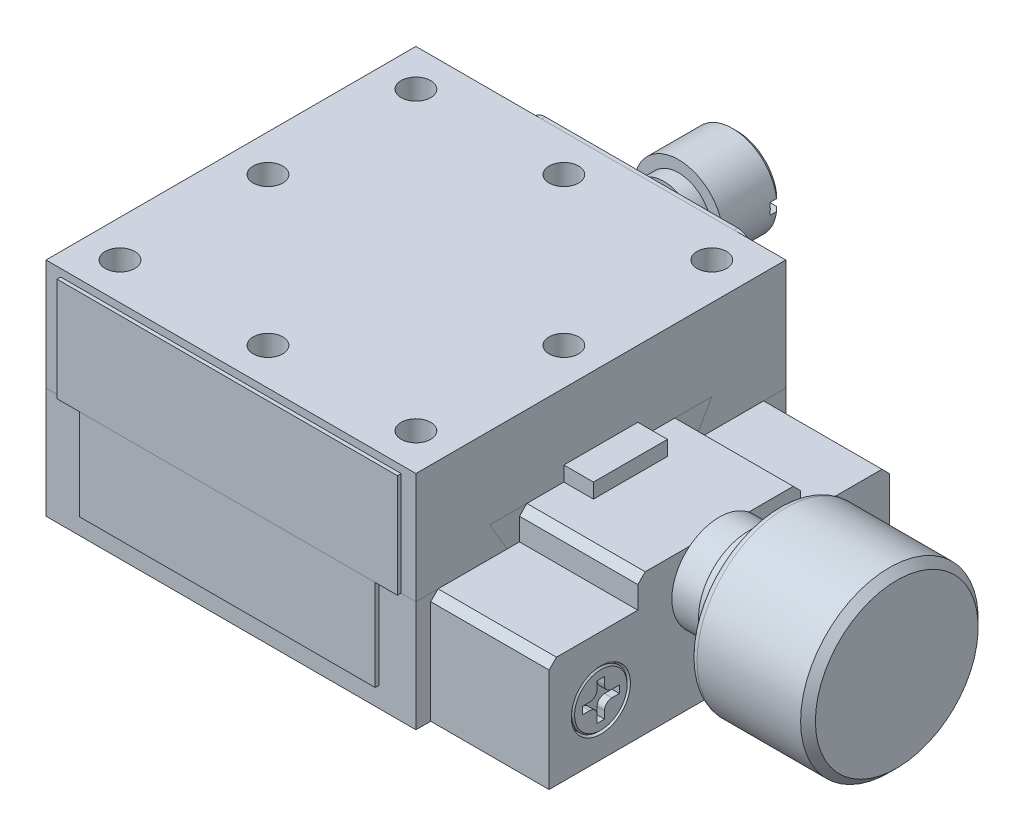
from build123d import *

# Parameters (mm, degrees)
SKETCH1_W              = 25
SKETCH1_H              = 15
EXTRUDE1_DEPTH         = 12.5
SPLIT1_SURFACE_1_BACK  = 39.406
SPLIT1_SURFACE_1_DEPTH = 78.812
SPLIT1_SURFACE_2_BACK  = 39.406
SPLIT1_SURFACE_2_DEPTH = 78.812
EXTRUDE2_DEPTH         = 8
LPATTERN1_COUNT        = 2
LPATTERN1_PITCH        = 10
LPATTERN1_COL_COUNT    = 2
LPATTERN1_COL_PITCH    = 10
LPATTERN2_COUNT        = 2
LPATTERN2_PITCH        = 20
LPATTERN3_COUNT        = 2
LPATTERN3_PITCH        = 20
SKETCH9_W              = 2
SKETCH9_H              = 5
EXTRUDE3_DEPTH         = 1
SKETCH11_W             = 0.75
SKETCH11_H             = 0.75
CUT_EXTRUDE2_DEPTH     = 5.75
LPATTERN4_COUNT        = 2
LPATTERN4_PITCH        = 20
LPATTERN4_COUNT_DIR2   = 2
LPATTERN4_PITCH_DIR2   = 20
EXTRUDE4_DEPTH         = 0.25
EXTRUDE6_DEPTH         = 0.25
SKETCH26_W             = 23
SKETCH26_H             = 7
EXTRUDE9_DEPTH         = 0.25
SKETCH15_R             = 2
CUT_EXTRUDE3_DEPTH     = 2
SKETCH16_R             = 1.875
EXTRUDE7_DEPTH         = 2
CHAMFER1_SIZE          = 0.1
CUT_EXTRUDE4_DEPTH     = 0.5
FILLET2_R              = 0.5
LPATTERN5_COUNT        = 2
LPATTERN5_PITCH        = 16
SKETCH18_R             = 1
EXTRUDE8_DEPTH         = 0.8
EXTRUDE8_2_DEPTH       = 0.8
FILLET1_R              = 0.25
FILLET3_R              = 0.25
CUT_EXTRUDE5_DEPTH     = 0.25
SKETCH20_W             = 1.5
SKETCH20_H             = 6.15
CUT_EXTRUDE6_DEPTH     = 0.25
CHAMFER2_SIZE          = 0.5
CUT_EXTRUDE_1_DEPTH    = 0.02
SKETCH_4_W             = 3
SKETCH_4_H             = 3
CUT_EXTRUDE_2_DEPTH    = 0.01
CUT_EXTRUDE_3_DEPTH    = 0.02
CUT_EXTRUDE_4_DEPTH    = 0.02


with BuildPart() as part:
    # Sketch1 → Extrude1 (new, symmetric)
    with BuildSketch(Plane.XY):
        Rectangle(SKETCH1_W, SKETCH1_H)
    extrude(amount=EXTRUDE1_DEPTH, both=True)


with BuildPart() as body_2:
    # Split1: the piece behind the surface
    add(part.part)
    # Split1 surface: a surface, the sketch's curves swept straight by 78.812 mm
    with BuildLine(Plane.ZY.offset(12.5).offset(-SPLIT1_SURFACE_1_BACK), mode=Mode.PRIVATE) as split1_surface_1_path:
        Line((-12.5, 0), (-6.345299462, 0))
        Line((-6.345299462, 0), (-7.5, 2))
        Line((-7.5, 2), (7.5, 2))
        Line((7.5, 2), (6.345299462, 0))
        Line((6.345299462, 0), (12.5, 0))
    split1_surface_1 = Shell.extrude(split1_surface_1_path.wire(), (-1 * SPLIT1_SURFACE_1_DEPTH, 0 * SPLIT1_SURFACE_1_DEPTH, 0 * SPLIT1_SURFACE_1_DEPTH))
    split(bisect_by=split1_surface_1, keep=Keep.BOTTOM)

    # Sketch12 → Cut-Revolve3 (revolve, cut)
    with BuildSketch(Plane.XY.offset(10), mode=Mode.PRIVATE) as cut_revolve3_sk:
        Polygon((-10, 0), (-7.9, 0), (-7.9, -3), (-8.75, -3), (-8.75, -7.5), (-10, -7.5), align=None)
    cut_revolve3 = revolve(cut_revolve3_sk.sketch.rotate(Axis((-10, 0.586801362, 10), (0, -1, 0)), 180), axis=Axis((-10, 0.586801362, 10), (0, -1, 0)), mode=Mode.SUBTRACT)

    # LPattern4: Cut-Revolve3 2 × 2
    with Locations(*[(j * LPATTERN4_PITCH_DIR2, 0, -i * LPATTERN4_PITCH) for i in range(LPATTERN4_COUNT) for j in range(LPATTERN4_COUNT_DIR2) if (i, j) != (0, 0)]):
        add(cut_revolve3, mode=Mode.SUBTRACT)

    # Sketch 3 → Cut-Extrude 1 (cut)
    with BuildSketch(Plane.ZY.offset(12.5)):
        with BuildLine():
            Line((-4.35779293, -4.064496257), (-4.35779293, -3.172823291))
            Line((-4.35779293, -3.172823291), (-4.059309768, -3.172823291))
            ThreePointArc((-4.059309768, -3.172823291), (-3.993107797, -3.145401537), (-3.965686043, -3.079199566))
            Line((-3.965686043, -3.079199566), (-3.965686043, -2.870443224))
            Line((-3.965686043, -2.870443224), (-5.046786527, -2.870443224))
            Line((-5.046786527, -2.870443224), (-5.046786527, -3.167221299))
            Line((-5.046786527, -3.167221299), (-4.659801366, -3.167221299))
            Line((-4.659801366, -3.167221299), (-4.659801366, -3.969203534))
            ThreePointArc((-4.659801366, -3.969203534), (-4.632643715, -4.035140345), (-4.566926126, -4.062824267))
            Line((-4.566926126, -4.062824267), (-4.35779293, -4.064496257))
        make_face()
        with BuildLine():
            Line((-5.128364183, -4.062081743), (-5.128364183, -2.870443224))
            Line((-5.128364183, -2.870443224), (-5.466710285, -2.870443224))
            Line((-5.466710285, -2.870443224), (-5.816698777, -3.68193519))
            Line((-5.816698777, -3.68193519), (-6.166687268, -2.870443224))
            Line((-6.166687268, -2.870443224), (-6.505033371, -2.870443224))
            Line((-6.505033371, -2.870443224), (-6.505033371, -4.062081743))
            Line((-6.505033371, -4.062081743), (-6.303874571, -4.062081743))
            ThreePointArc((-6.303874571, -4.062081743), (-6.237672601, -4.034659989), (-6.210250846, -3.968458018))
            Line((-6.210250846, -3.968458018), (-6.210250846, -3.369203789))
            Line((-6.210250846, -3.369203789), (-5.904240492, -4.062081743))
            Line((-5.904240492, -4.062081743), (-5.729157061, -4.062081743))
            Line((-5.729157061, -4.062081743), (-5.423146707, -3.369203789))
            Line((-5.423146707, -3.369203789), (-5.423146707, -3.968458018))
            ThreePointArc((-5.423146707, -3.968458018), (-5.395724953, -4.034659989), (-5.329522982, -4.062081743))
            Line((-5.329522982, -4.062081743), (-5.128364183, -4.062081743))
        make_face()
        with BuildLine():
            Line((-6.582853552, -3.019354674), (-6.582853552, -2.870443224))
            Line((-6.582853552, -2.870443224), (-7.21377394, -2.870443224))
            ThreePointArc((-7.21377394, -2.870443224), (-7.716480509, -3.466262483), (-7.21377394, -4.062081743))
            Line((-7.21377394, -4.062081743), (-6.589362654, -4.062081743))
            Line((-6.589362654, -4.062081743), (-6.589362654, -3.328268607))
            Line((-6.589362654, -3.328268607), (-7.191483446, -3.328268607))
            Line((-7.191483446, -3.328268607), (-7.191483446, -3.488854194))
            ThreePointArc((-7.191483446, -3.488854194), (-7.164061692, -3.555056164), (-7.097859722, -3.582477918))
            Line((-7.097859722, -3.582477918), (-6.848593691, -3.582477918))
            Line((-6.848593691, -3.582477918), (-6.848593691, -3.810414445))
            Line((-6.848593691, -3.810414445), (-7.21377394, -3.810414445))
            ThreePointArc((-7.21377394, -3.810414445), (-7.407220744, -3.461696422), (-7.21377394, -3.112978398))
            Line((-7.21377394, -3.112978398), (-6.676477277, -3.112978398))
            ThreePointArc((-6.676477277, -3.112978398), (-6.610275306, -3.085556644), (-6.582853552, -3.019354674))
        make_face()
        with BuildLine():
            Line((-9.564202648, -4.399788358), (-8.67711501, -4.394927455))
            Line((-8.67711501, -4.394927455), (-8.302188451, -3.442445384))
            Line((-8.302188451, -3.442445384), (-8.639979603, -3.442692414))
            Line((-8.639979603, -3.442692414), (-8.956532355, -3.849589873))
            ThreePointArc((-8.956532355, -3.849589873), (-9.176772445, -3.846588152), (-9.396623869, -3.833169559))
            ThreePointArc((-9.396623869, -3.833169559), (-9.578164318, -3.820074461), (-9.756797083, -3.785163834))
            ThreePointArc((-9.756797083, -3.785163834), (-9.902780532, -3.742276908), (-10.036931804, -3.670486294))
            ThreePointArc((-10.036931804, -3.670486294), (-10.088673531, -3.618770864), (-10.10744713, -3.548065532))
            ThreePointArc((-10.10744713, -3.548065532), (-10.092595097, -3.494260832), (-10.063017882, -3.44692462))
            ThreePointArc((-10.063017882, -3.44692462), (-9.993028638, -3.373964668), (-9.912273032, -3.313135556))
            ThreePointArc((-9.912273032, -3.313135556), (-9.812475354, -3.254001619), (-9.708660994, -3.20224278))
            ThreePointArc((-9.708660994, -3.20224278), (-9.581674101, -3.153950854), (-9.455900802, -3.102581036))
            ThreePointArc((-9.455900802, -3.102581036), (-9.342546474, -3.069139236), (-9.229401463, -3.034995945))
            ThreePointArc((-9.229401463, -3.034995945), (-9.11843186, -3.000305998), (-9.004727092, -2.976039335))
            ThreePointArc((-9.004727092, -2.976039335), (-8.910030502, -2.959324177), (-8.816560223, -2.936737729))
            ThreePointArc((-8.816560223, -2.936737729), (-8.696430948, -2.912486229), (-8.575912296, -2.890250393))
            ThreePointArc((-8.575912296, -2.890250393), (-8.46154231, -2.873398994), (-8.348425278, -2.849545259))
            ThreePointArc((-8.348425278, -2.849545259), (-8.246656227, -2.838465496), (-8.146219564, -2.818662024))
            ThreePointArc((-8.146219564, -2.818662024), (-8.053640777, -2.805593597), (-7.960983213, -2.79309595))
            ThreePointArc((-7.960983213, -2.79309595), (-7.885829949, -2.782304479), (-7.810104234, -2.776819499))
            Line((-7.810104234, -2.776819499), (-7.810104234, -2.69026576))
            ThreePointArc((-7.810104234, -2.69026576), (-7.880588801, -2.691701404), (-7.950783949, -2.698241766))
            ThreePointArc((-7.950783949, -2.698241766), (-8.074372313, -2.710277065), (-8.1980503, -2.721353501))
            ThreePointArc((-8.1980503, -2.721353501), (-8.239603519, -2.725722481), (-8.281116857, -2.730455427))
            ThreePointArc((-8.281116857, -2.730455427), (-8.385935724, -2.741364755), (-8.49008593, -2.757450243))
            ThreePointArc((-8.49008593, -2.757450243), (-8.608303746, -2.767462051), (-8.7256085, -2.78521826))
            ThreePointArc((-8.7256085, -2.78521826), (-8.827271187, -2.794985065), (-8.927671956, -2.81370345))
            ThreePointArc((-8.927671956, -2.81370345), (-9.039822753, -2.837894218), (-9.153045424, -2.856431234))
            ThreePointArc((-9.153045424, -2.856431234), (-9.283280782, -2.880473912), (-9.413097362, -2.906683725))
            ThreePointArc((-9.413097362, -2.906683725), (-9.552504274, -2.939229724), (-9.690598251, -2.976960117))
            ThreePointArc((-9.690598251, -2.976960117), (-9.825137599, -3.011860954), (-9.957519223, -3.054216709))
            ThreePointArc((-9.957519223, -3.054216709), (-10.049615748, -3.086668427), (-10.141634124, -3.119341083))
            ThreePointArc((-10.141634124, -3.119341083), (-10.273630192, -3.175440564), (-10.402823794, -3.237723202))
            ThreePointArc((-10.402823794, -3.237723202), (-10.541494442, -3.312416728), (-10.676544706, -3.393472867))
            ThreePointArc((-10.676544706, -3.393472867), (-10.797621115, -3.497504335), (-10.903942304, -3.616575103))
            ThreePointArc((-10.903942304, -3.616575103), (-10.970859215, -3.72572189), (-11.000795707, -3.850199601))
            ThreePointArc((-11.000795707, -3.850199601), (-10.98200688, -3.947748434), (-10.924996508, -4.029103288))
            ThreePointArc((-10.924996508, -4.029103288), (-10.786715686, -4.137987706), (-10.630221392, -4.218529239))
            ThreePointArc((-10.630221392, -4.218529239), (-10.41415359, -4.283647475), (-10.193562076, -4.331240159))
            ThreePointArc((-10.193562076, -4.331240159), (-10.028006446, -4.355325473), (-9.861710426, -4.373612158))
            ThreePointArc((-9.861710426, -4.373612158), (-9.712922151, -4.386309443), (-9.564202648, -4.399788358))
        make_face()
    extrude(amount=-CUT_EXTRUDE_1_DEPTH, mode=Mode.SUBTRACT)

    # Sketch 4 → Cut-Extrude 2 (cut)
    with BuildSketch(Plane.ZY.offset(12.5)):
        with Locations((-9.65, -3.3)):
            Rectangle(SKETCH_4_W, SKETCH_4_H)
    extrude(amount=-CUT_EXTRUDE_2_DEPTH, mode=Mode.SUBTRACT)

    # Sketch 5 → Cut-Extrude 3 (cut)
    # profile 1 of 7: a face of its own
    with BuildSketch(Plane.ZY.offset(12.5)):
        with BuildLine():
            Line((9.946153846, -1.6), (10.423076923, -1.6))
            Line((10.423076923, -1.6), (10.407692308, -1.707692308))
            Line((10.407692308, -1.707692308), (10.024278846, -1.707692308))
            Line((10.024278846, -1.707692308), (9.932211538, -2.004086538))
            add(Edge.make_bspline(
                [(9.932211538, -2.004086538), (9.938462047, -2.003533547), (9.95032002, -2.002484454), (9.967204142, -2.000868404), (9.982205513, -2.000186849), (9.991586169, -2.000058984), (9.995913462, -2)],
                knots=[0, 0, 0, 0, 1.179194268, 2.23707438, 3.186763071, 4, 4, 4, 4], degree=3))
            add(Edge.make_bspline(
                [(9.995913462, -2), (10.010146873, -2.000599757), (10.038602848, -2.001798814), (10.080588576, -2.011595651), (10.121441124, -2.027522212), (10.160935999, -2.04926293), (10.197808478, -2.07693626), (10.231425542, -2.109639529), (10.260581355, -2.147804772), (10.285405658, -2.190493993), (10.305450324, -2.236657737), (10.320344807, -2.285387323), (10.329137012, -2.336379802), (10.330220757, -2.371120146), (10.330769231, -2.388701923)],
                knots=[0, 0, 0, 0, 0.899783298, 1.798880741, 2.712146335, 3.667462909, 4.641893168, 5.620639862, 6.625573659, 7.670753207, 8.73789667, 9.802833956, 10.8880339, 12, 12, 12, 12], degree=3))
            add(Edge.make_bspline(
                [(10.330769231, -2.388701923), (10.330565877, -2.398643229), (10.33016011, -2.418479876), (10.327470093, -2.447943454), (10.323086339, -2.476985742), (10.317220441, -2.505544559), (10.309097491, -2.533576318), (10.29958903, -2.56114976), (10.288173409, -2.588281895), (10.275103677, -2.614705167), (10.260424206, -2.640060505), (10.244878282, -2.664125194), (10.228204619, -2.68662983), (10.210385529, -2.707600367), (10.19142544, -2.727028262), (10.17143157, -2.744975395), (10.150159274, -2.761012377), (10.128084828, -2.775768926), (10.104977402, -2.788694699), (10.081240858, -2.80002325), (10.056725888, -2.809500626), (10.031516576, -2.817023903), (10.005666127, -2.823496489), (9.979044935, -2.827733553), (9.951726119, -2.830107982), (9.933337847, -2.830547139), (9.924038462, -2.830769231)],
                knots=[0, 0, 0, 0, 1.069153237, 2.133363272, 3.179058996, 4.226954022, 5.266274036, 6.315550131, 7.362275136, 8.42982956, 9.483766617, 10.51159017, 11.509535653, 12.493806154, 13.468866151, 14.427139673, 15.380284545, 16.331557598, 17.280759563, 18.225176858, 19.15820187, 20.104151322, 21.053079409, 22.022142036, 22.999750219, 24, 24, 24, 24], degree=3))
            add(Edge.make_bspline(
                [(9.924038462, -2.830769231), (9.91425713, -2.830579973), (9.894891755, -2.830205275), (9.866258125, -2.827359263), (9.838598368, -2.822166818), (9.811684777, -2.815557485), (9.785757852, -2.806587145), (9.760663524, -2.795777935), (9.736525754, -2.782905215), (9.713108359, -2.768287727), (9.690709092, -2.751354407), (9.669199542, -2.732276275), (9.648772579, -2.710889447), (9.629589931, -2.687014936), (9.610739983, -2.6614691), (9.593212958, -2.633354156), (9.576601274, -2.603093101), (9.566629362, -2.581789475), (9.561538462, -2.570913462)],
                knots=[0, 0, 0, 0, 0.988269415, 1.95660558, 2.903067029, 3.829898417, 4.754180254, 5.671628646, 6.587933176, 7.515648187, 8.458049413, 9.421533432, 10.417927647, 11.442155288, 12.514193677, 13.623848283, 14.786917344, 16, 16, 16, 16], degree=3))
            Line((9.561538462, -2.570913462), (9.671875, -2.523076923))
            add(Edge.make_bspline(
                [(9.671875, -2.523076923), (9.675382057, -2.53113624), (9.682279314, -2.546986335), (9.694101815, -2.569492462), (9.70661317, -2.590578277), (9.720098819, -2.61010268), (9.734476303, -2.628095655), (9.749707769, -2.644604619), (9.765852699, -2.659466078), (9.787982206, -2.677341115), (9.817660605, -2.695299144), (9.854924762, -2.711546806), (9.893977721, -2.721294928), (9.920539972, -2.722480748), (9.933894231, -2.723076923)],
                knots=[0, 0, 0, 0, 0.90275949, 1.775438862, 2.609846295, 3.420523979, 4.211225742, 4.974361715, 5.725863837, 6.463852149, 7.894145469, 9.273469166, 10.629227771, 12, 12, 12, 12], degree=3))
            add(Edge.make_bspline(
                [(9.933894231, -2.723076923), (9.942962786, -2.72278184), (9.960951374, -2.722196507), (9.987576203, -2.718047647), (10.013468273, -2.710944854), (10.038870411, -2.701296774), (10.063663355, -2.688821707), (10.087554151, -2.673167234), (10.110913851, -2.655048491), (10.133614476, -2.634592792), (10.154796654, -2.611747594), (10.173027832, -2.586388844), (10.188574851, -2.559160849), (10.201381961, -2.530116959), (10.210859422, -2.498905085), (10.218208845, -2.466076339), (10.222220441, -2.431108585), (10.222786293, -2.40722096), (10.223076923, -2.394951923)],
                knots=[0, 0, 0, 0, 0.894042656, 1.773442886, 2.649322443, 3.537059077, 4.448663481, 5.380047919, 6.348784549, 7.361222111, 8.390141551, 9.414226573, 10.433393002, 11.477070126, 12.53659607, 13.644646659, 14.790255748, 16, 16, 16, 16], degree=3))
            add(Edge.make_bspline(
                [(10.223076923, -2.394951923), (10.222835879, -2.384606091), (10.222361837, -2.364259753), (10.218943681, -2.334516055), (10.213486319, -2.306175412), (10.205609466, -2.279402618), (10.195077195, -2.254218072), (10.182675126, -2.230393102), (10.167877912, -2.208053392), (10.150847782, -2.187533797), (10.132186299, -2.168857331), (10.112208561, -2.152268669), (10.090670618, -2.138681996), (10.068169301, -2.127098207), (10.044203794, -2.118540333), (10.019007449, -2.112273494), (9.992593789, -2.108302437), (9.974533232, -2.107897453), (9.965384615, -2.107692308)],
                knots=[0, 0, 0, 0, 1.147206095, 2.25612032, 3.315727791, 4.344786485, 5.344851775, 6.338579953, 7.319511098, 8.310533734, 9.290780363, 10.244278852, 11.183466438, 12.109444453, 13.045558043, 13.998186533, 14.985976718, 16, 16, 16, 16], degree=3))
            add(Edge.make_bspline(
                [(9.965384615, -2.107692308), (9.950369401, -2.108241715), (9.919593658, -2.1093678), (9.872665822, -2.117570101), (9.823994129, -2.13039908), (9.791799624, -2.142866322), (9.775240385, -2.149278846)],
                knots=[0, 0, 0, 0, 0.919956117, 1.88557634, 2.91244643, 4, 4, 4, 4], degree=3))
            Line((9.775240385, -2.149278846), (9.946153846, -1.6))
        make_face()
    # profile 2 of 7: a face of its own
    with BuildSketch(Plane.ZY.offset(12.5)):
        with BuildLine():
            Line((8.869230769, -1.953846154), (8.761538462, -1.953846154))
            add(Edge.make_bspline(
                [(8.761538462, -1.953846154), (8.76258714, -1.938996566), (8.764636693, -1.909974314), (8.771554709, -1.867905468), (8.780662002, -1.828230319), (8.793343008, -1.791393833), (8.808329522, -1.756913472), (8.826856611, -1.725355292), (8.84772192, -1.696027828), (8.871605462, -1.669596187), (8.897814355, -1.646025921), (8.926077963, -1.625450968), (8.956252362, -1.608129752), (8.988268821, -1.59376035), (9.022229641, -1.582812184), (9.057941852, -1.574809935), (9.095556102, -1.570266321), (9.121221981, -1.569581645), (9.134375, -1.569230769)],
                knots=[0, 0, 0, 0, 1.189755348, 2.325275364, 3.405357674, 4.440728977, 5.436073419, 6.406440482, 7.361305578, 8.309505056, 9.248656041, 10.17524323, 11.099501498, 12.025889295, 12.976164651, 13.947715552, 14.948263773, 16, 16, 16, 16], degree=3))
            add(Edge.make_bspline(
                [(9.134375, -1.569230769), (9.145522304, -1.569531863), (9.167491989, -1.570125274), (9.199754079, -1.574091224), (9.230501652, -1.581533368), (9.259930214, -1.591188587), (9.287737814, -1.604220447), (9.314434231, -1.619513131), (9.339374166, -1.638234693), (9.362858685, -1.659238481), (9.384093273, -1.682372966), (9.402651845, -1.707069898), (9.418874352, -1.732849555), (9.431392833, -1.760463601), (9.441744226, -1.789092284), (9.448527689, -1.819224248), (9.453081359, -1.85058191), (9.453588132, -1.872018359), (9.453846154, -1.882932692)],
                knots=[0, 0, 0, 0, 1.070123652, 2.10905505, 3.112767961, 4.102712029, 5.07666027, 6.055516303, 7.050824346, 8.063894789, 9.076439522, 10.059426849, 11.02639504, 11.993363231, 12.96399535, 13.943485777, 14.952929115, 16, 16, 16, 16], degree=3))
            add(Edge.make_bspline(
                [(9.453846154, -1.882932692), (9.453307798, -1.898440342), (9.452225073, -1.929628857), (9.442801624, -1.976107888), (9.428038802, -2.022312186), (9.410714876, -2.060956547), (9.391761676, -2.093458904), (9.372710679, -2.121927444), (9.34879737, -2.154101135), (9.319963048, -2.189921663), (9.286580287, -2.22978538), (9.248362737, -2.273475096), (9.205240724, -2.320839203), (9.17464583, -2.353408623), (9.158653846, -2.370432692)],
                knots=[0, 0, 0, 0, 0.954226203, 1.919110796, 2.908529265, 3.937684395, 4.519156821, 5.224000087, 6.046133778, 6.987113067, 8.055518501, 9.248081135, 10.561569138, 12, 12, 12, 12], degree=3))
            Line((9.158653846, -2.370432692), (8.862740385, -2.692307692))
            Line((8.862740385, -2.692307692), (9.392307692, -2.692307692))
            Line((9.392307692, -2.692307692), (9.378605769, -2.8))
            Line((9.378605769, -2.8), (8.623076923, -2.8))
            Line((8.623076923, -2.8), (9.025240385, -2.362740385))
            add(Edge.make_bspline(
                [(9.025240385, -2.362740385), (9.034622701, -2.352490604), (9.052928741, -2.332492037), (9.079577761, -2.303134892), (9.104938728, -2.275348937), (9.128393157, -2.24851118), (9.150775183, -2.223365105), (9.171745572, -2.199535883), (9.191167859, -2.177044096), (9.209026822, -2.155732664), (9.225542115, -2.135868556), (9.240729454, -2.117455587), (9.254216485, -2.100199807), (9.266489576, -2.084542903), (9.277074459, -2.069924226), (9.286496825, -2.056920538), (9.294139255, -2.044995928), (9.306649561, -2.025411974), (9.320941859, -1.996502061), (9.335544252, -1.958101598), (9.344322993, -1.919864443), (9.34555178, -1.894432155), (9.346153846, -1.881971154)],
                knots=[0, 0, 0, 0, 1.413351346, 2.757620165, 4.032814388, 5.239603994, 6.38276682, 7.456908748, 8.468208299, 9.405290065, 10.284970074, 11.095810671, 11.832795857, 12.512582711, 13.11898356, 13.668494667, 14.145465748, 14.559277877, 16.031828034, 17.414029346, 18.732957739, 20, 20, 20, 20], degree=3))
            add(Edge.make_bspline(
                [(9.346153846, -1.881971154), (9.34597263, -1.874910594), (9.345616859, -1.861049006), (9.342698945, -1.840639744), (9.337628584, -1.821154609), (9.330592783, -1.802469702), (9.321620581, -1.784608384), (9.310823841, -1.767415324), (9.297719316, -1.751316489), (9.282842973, -1.736257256), (9.266595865, -1.722435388), (9.24932912, -1.709947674), (9.230604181, -1.699982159), (9.21112772, -1.691425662), (9.190464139, -1.685001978), (9.168870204, -1.680080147), (9.146054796, -1.677527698), (9.130534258, -1.677127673), (9.122596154, -1.676923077)],
                knots=[0, 0, 0, 0, 1.000465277, 1.9641554, 2.914502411, 3.848972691, 4.78860488, 5.743285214, 6.720598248, 7.724474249, 8.739530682, 9.741606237, 10.737743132, 11.739883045, 12.752776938, 13.799858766, 14.874720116, 16, 16, 16, 16], degree=3))
            add(Edge.make_bspline(
                [(9.122596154, -1.676923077), (9.113770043, -1.677155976), (9.096532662, -1.677610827), (9.07127351, -1.681117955), (9.047153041, -1.68653329), (9.024153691, -1.694488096), (9.002532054, -1.70497386), (8.981846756, -1.717214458), (8.962535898, -1.73202602), (8.944603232, -1.749049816), (8.928159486, -1.768072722), (8.913768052, -1.789091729), (8.901106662, -1.81190487), (8.890597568, -1.836646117), (8.882191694, -1.863314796), (8.875772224, -1.891781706), (8.871078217, -1.922139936), (8.869857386, -1.943092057), (8.869230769, -1.953846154)],
                knots=[0, 0, 0, 0, 1.007553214, 1.967749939, 2.906652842, 3.826866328, 4.739542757, 5.646559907, 6.567091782, 7.512083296, 8.465849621, 9.432866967, 10.41581379, 11.440668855, 12.496904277, 13.604523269, 14.770473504, 16, 16, 16, 16], degree=3))
        make_face()
    # profile 3 of 7: a face of its own
    with BuildSketch(Plane.ZY.offset(12.5)):
        Polygon((8.113701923, -2.307692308), (8.561538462, -2.307692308), (8.546875, -2.415384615), (8.1, -2.415384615), align=None)
    # profile 4 of 7: a face of its own
    with BuildSketch(Plane.ZY.offset(12.5)):
        Polygon((7.560096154, -1.6), (7.965384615, -2.8), (7.852644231, -2.8), (7.717307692, -2.4), (7.189182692, -2.4), (6.956730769, -2.8), (6.834615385, -2.8), (7.532451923, -1.6), align=None)
        Polygon((7.523076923, -1.825240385), (7.251682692, -2.292307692), (7.680769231, -2.292307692), align=None, mode=Mode.SUBTRACT)
    # profile 5 of 7: a face of its own
    with BuildSketch(Plane.ZY.offset(12.5)):
        Polygon((6.312259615, -1.6), (6.560096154, -1.6), (6.393028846, -2.8), (6.284615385, -2.8), (6.436538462, -1.707692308), (6.269230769, -1.707692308), align=None)
    # profile 6 of 7: a face of its own
    with BuildSketch(Plane.ZY.offset(12.5)):
        with BuildLine():
            Line((5.869230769, -1.761538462), (5.797115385, -1.861538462))
            add(Edge.make_bspline(
                [(5.797115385, -1.861538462), (5.781015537, -1.846824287), (5.749434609, -1.817961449), (5.698571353, -1.780280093), (5.646039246, -1.748366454), (5.591762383, -1.722306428), (5.53583486, -1.701859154), (5.478218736, -1.687543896), (5.418874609, -1.678520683), (5.378718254, -1.677459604), (5.358413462, -1.676923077)],
                knots=[0, 0, 0, 0, 1.071509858, 2.101838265, 3.105566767, 4.088534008, 5.056617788, 6.027134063, 7.002433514, 8, 8, 8, 8], degree=3))
            add(Edge.make_bspline(
                [(5.358413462, -1.676923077), (5.345104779, -1.677156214), (5.318678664, -1.677619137), (5.279393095, -1.681264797), (5.240866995, -1.687562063), (5.20297342, -1.696251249), (5.165716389, -1.707315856), (5.129039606, -1.720745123), (5.093157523, -1.737014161), (5.058081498, -1.755386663), (5.024173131, -1.775694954), (4.992279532, -1.798142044), (4.961994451, -1.822015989), (4.933643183, -1.847643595), (4.907406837, -1.875280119), (4.882772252, -1.904249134), (4.860441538, -1.935263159), (4.83979737, -1.967553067), (4.821360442, -2.00101739), (4.805427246, -2.035331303), (4.79191924, -2.070258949), (4.780876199, -2.105846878), (4.772176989, -2.142057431), (4.765880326, -2.178904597), (4.762241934, -2.216432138), (4.761773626, -2.24165901), (4.761538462, -2.254326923)],
                knots=[0, 0, 0, 0, 1.038808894, 2.06268977, 3.07662516, 4.084154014, 5.095481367, 6.108721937, 7.130613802, 8.168612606, 9.198437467, 10.213568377, 11.210969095, 12.207329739, 13.193903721, 14.183803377, 15.173465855, 16.174683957, 17.174102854, 18.153572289, 19.125845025, 20.09527659, 21.060177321, 22.030919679, 23.011207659, 24, 24, 24, 24], degree=3))
            add(Edge.make_bspline(
                [(4.761538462, -2.254326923), (4.761710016, -2.265552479), (4.762048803, -2.287720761), (4.765133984, -2.320445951), (4.769467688, -2.352300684), (4.776401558, -2.383064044), (4.784681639, -2.413104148), (4.795329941, -2.442032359), (4.807604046, -2.470094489), (4.821741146, -2.497063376), (4.837987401, -2.52267079), (4.85534048, -2.547388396), (4.875005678, -2.570131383), (4.896033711, -2.591737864), (4.918774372, -2.611936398), (4.943511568, -2.630318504), (4.969425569, -2.647918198), (4.997378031, -2.663224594), (5.026307, -2.677652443), (5.056750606, -2.689458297), (5.087987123, -2.699938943), (5.120389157, -2.708251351), (5.153727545, -2.715140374), (5.188214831, -2.719480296), (5.22358196, -2.722564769), (5.24750903, -2.722904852), (5.259615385, -2.723076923)],
                knots=[0, 0, 0, 0, 1.050288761, 2.074115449, 3.074185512, 4.056755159, 5.022963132, 5.98847243, 6.938717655, 7.888015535, 8.834733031, 9.775342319, 10.711547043, 11.644864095, 12.595819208, 13.554196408, 14.527565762, 15.524707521, 16.534208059, 17.550758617, 18.577574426, 19.616152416, 20.679451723, 21.761233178, 22.867253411, 24, 24, 24, 24], degree=3))
            add(Edge.make_bspline(
                [(5.259615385, -2.723076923), (5.278223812, -2.722662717), (5.315313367, -2.721837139), (5.37038226, -2.715139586), (5.424486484, -2.704340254), (5.47759355, -2.68905673), (5.529807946, -2.669640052), (5.580963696, -2.645546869), (5.631366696, -2.617630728), (5.663387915, -2.595697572), (5.679567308, -2.584615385)],
                knots=[0, 0, 0, 0, 0.99335309, 1.979910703, 2.957437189, 3.936535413, 4.927536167, 5.928599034, 6.953381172, 8, 8, 8, 8], degree=3))
            Line((5.679567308, -2.584615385), (5.746153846, -2.679567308))
            add(Edge.make_bspline(
                [(5.746153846, -2.679567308), (5.734583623, -2.6867797), (5.711954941, -2.700885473), (5.678044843, -2.720158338), (5.645684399, -2.738053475), (5.614493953, -2.753993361), (5.58456667, -2.7682353), (5.555704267, -2.780398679), (5.528292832, -2.791151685), (5.492890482, -2.802822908), (5.447392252, -2.81411421), (5.390128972, -2.823982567), (5.328803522, -2.829730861), (5.286630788, -2.830416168), (5.264903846, -2.830769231)],
                knots=[0, 0, 0, 0, 0.95718736, 1.872037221, 2.738173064, 3.553405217, 4.331061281, 5.064628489, 5.752111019, 6.397930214, 7.680580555, 9.03930081, 10.474679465, 12, 12, 12, 12], degree=3))
            add(Edge.make_bspline(
                [(5.264903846, -2.830769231), (5.244693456, -2.830448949), (5.205140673, -2.829822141), (5.147337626, -2.823486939), (5.092352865, -2.814224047), (5.040323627, -2.800258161), (4.990924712, -2.782991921), (4.944685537, -2.761040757), (4.900880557, -2.736037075), (4.874315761, -2.715846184), (4.861057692, -2.705769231)],
                knots=[0, 0, 0, 0, 1.124936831, 2.201559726, 3.234383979, 4.226808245, 5.197736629, 6.143845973, 7.073622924, 8, 8, 8, 8], degree=3))
            add(Edge.make_bspline(
                [(4.861057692, -2.705769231), (4.852658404, -2.698713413), (4.836011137, -2.684728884), (4.812403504, -2.662600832), (4.79046382, -2.639504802), (4.770266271, -2.615339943), (4.751466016, -2.590503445), (4.734708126, -2.564572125), (4.719061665, -2.538101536), (4.705633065, -2.510462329), (4.693086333, -2.482204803), (4.682656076, -2.452917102), (4.673665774, -2.422762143), (4.66655066, -2.391661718), (4.660722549, -2.35975243), (4.656671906, -2.326928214), (4.65420085, -2.293308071), (4.653965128, -2.27059722), (4.653846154, -2.259134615)],
                knots=[0, 0, 0, 0, 1.031438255, 2.044295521, 3.04101972, 4.02510288, 5.004675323, 5.96814667, 6.927099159, 7.894246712, 8.855978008, 9.833229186, 10.815522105, 11.813498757, 12.831862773, 13.86462134, 14.922233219, 16, 16, 16, 16], degree=3))
            add(Edge.make_bspline(
                [(4.653846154, -2.259134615), (4.653966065, -2.247271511), (4.65420452, -2.223680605), (4.65668805, -2.188621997), (4.66071971, -2.154196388), (4.666574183, -2.120529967), (4.673704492, -2.087520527), (4.682625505, -2.055263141), (4.693241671, -2.023654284), (4.705533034, -1.992726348), (4.719176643, -1.962323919), (4.734672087, -1.93280756), (4.751423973, -1.903766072), (4.770285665, -1.875757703), (4.79055313, -1.848231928), (4.812301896, -1.821300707), (4.836078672, -1.795398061), (4.860844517, -1.769963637), (4.887021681, -1.745761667), (4.914099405, -1.722930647), (4.942102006, -1.701788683), (4.970685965, -1.681929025), (5.000228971, -1.664026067), (5.030452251, -1.647543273), (5.061509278, -1.632635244), (5.093355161, -1.619232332), (5.125973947, -1.607323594), (5.15941108, -1.597336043), (5.193647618, -1.58863003), (5.228611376, -1.581439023), (5.264385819, -1.575846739), (5.300980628, -1.572128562), (5.338345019, -1.569574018), (5.36353732, -1.569345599), (5.376201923, -1.569230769)],
                knots=[0, 0, 0, 0, 1.022044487, 2.032432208, 3.026697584, 4.007398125, 4.975698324, 5.935493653, 6.889610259, 7.847342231, 8.802158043, 9.759466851, 10.718641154, 11.689497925, 12.667180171, 13.663528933, 14.670419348, 15.695700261, 16.721678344, 17.740943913, 18.746223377, 19.744006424, 20.738655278, 21.721128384, 22.709310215, 23.705658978, 24.697235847, 25.699785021, 26.711210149, 27.740296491, 28.77439654, 29.829646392, 30.908925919, 32, 32, 32, 32], degree=3))
            add(Edge.make_bspline(
                [(5.376201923, -1.569230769), (5.399144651, -1.569693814), (5.444060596, -1.570600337), (5.509871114, -1.579033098), (5.572530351, -1.592550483), (5.622492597, -1.608824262), (5.661280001, -1.624702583), (5.690605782, -1.638269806), (5.719860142, -1.654348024), (5.749522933, -1.671863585), (5.779300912, -1.691325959), (5.809237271, -1.712895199), (5.839385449, -1.736312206), (5.859192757, -1.753054), (5.869230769, -1.761538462)],
                knots=[0, 0, 0, 0, 1.522680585, 2.981015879, 4.397098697, 5.773315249, 6.462902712, 7.179304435, 7.917249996, 8.678195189, 9.466166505, 10.278195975, 11.127418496, 12, 12, 12, 12], degree=3))
        make_face()
    # profile 7 of 7: a face of its own
    with BuildSketch(Plane.ZY.offset(12.5)):
        Polygon((4.392307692, -1.6), (4.392307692, -2.8), (4.284615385, -2.8), (4.284615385, -1.969711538), (3.802644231, -2.8), (3.774038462, -2.8), (3.446153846, -1.925), (3.211298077, -2.8), (3.1, -2.8), (3.423076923, -1.6), (3.437259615, -1.6), (3.805048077, -2.585576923), (4.376923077, -1.6), align=None)
    extrude(amount=-CUT_EXTRUDE_3_DEPTH, mode=Mode.SUBTRACT)

    # Sketch 7 → Cut-Extrude 4 (cut)
    # profile 1 of 14: a face of its own
    with BuildSketch(Plane.ZY.offset(12.5)):
        with BuildLine():
            Line((9.926602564, -5.915384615), (9.998878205, -5.915384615))
            Line((9.998878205, -5.915384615), (9.98525641, -6.011538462))
            add(Edge.make_bspline(
                [(9.98525641, -6.011538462), (9.99288861, -6.003039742), (10.007809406, -5.986424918), (10.032496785, -5.964841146), (10.057888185, -5.946322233), (10.084368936, -5.931336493), (10.111695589, -5.919521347), (10.140035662, -5.911126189), (10.169310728, -5.90600273), (10.189188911, -5.905421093), (10.199198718, -5.905128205)],
                knots=[0, 0, 0, 0, 1.109552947, 2.169153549, 3.180922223, 4.159977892, 5.120738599, 6.06878429, 7.027521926, 8, 8, 8, 8], degree=3))
            add(Edge.make_bspline(
                [(10.199198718, -5.905128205), (10.206790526, -5.905268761), (10.221698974, -5.905544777), (10.243489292, -5.908100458), (10.264122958, -5.912565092), (10.283782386, -5.918114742), (10.302112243, -5.92598177), (10.319416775, -5.935248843), (10.335466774, -5.946408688), (10.350387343, -5.959025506), (10.363798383, -5.973110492), (10.375681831, -5.988374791), (10.385332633, -6.005041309), (10.393763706, -6.022624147), (10.399833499, -6.041582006), (10.404433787, -6.061618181), (10.406915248, -6.082844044), (10.407323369, -6.097376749), (10.407532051, -6.104807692)],
                knots=[0, 0, 0, 0, 1.119369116, 2.198166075, 3.228739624, 4.23082604, 5.205280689, 6.164101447, 7.121237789, 8.082547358, 9.04094729, 9.984796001, 10.927855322, 11.875903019, 12.854964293, 13.856431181, 14.903938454, 16, 16, 16, 16], degree=3))
            add(Edge.make_bspline(
                [(10.407532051, -6.104807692), (10.407508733, -6.108120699), (10.407458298, -6.115286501), (10.406691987, -6.126874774), (10.405815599, -6.140081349), (10.40426839, -6.154920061), (10.402529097, -6.171375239), (10.400454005, -6.189546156), (10.397905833, -6.209315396), (10.395907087, -6.223026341), (10.394871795, -6.230128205)],
                knots=[0, 0, 0, 0, 0.630736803, 1.364239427, 2.21070615, 3.150983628, 4.204642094, 5.361642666, 6.633408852, 8, 8, 8, 8], degree=3))
            Line((10.394871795, -6.230128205), (10.356891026, -6.5))
            Line((10.356891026, -6.5), (10.284615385, -6.5))
            Line((10.284615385, -6.5), (10.322596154, -6.230128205))
            add(Edge.make_bspline(
                [(10.322596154, -6.230128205), (10.323561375, -6.223184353), (10.325424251, -6.209782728), (10.3280569, -6.190405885), (10.330063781, -6.172494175), (10.331920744, -6.156108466), (10.333156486, -6.141245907), (10.3341227, -6.127891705), (10.334862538, -6.116033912), (10.334912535, -6.108601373), (10.334935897, -6.105128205)],
                knots=[0, 0, 0, 0, 1.338652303, 2.583597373, 3.733668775, 4.780102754, 5.732207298, 6.581017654, 7.336920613, 8, 8, 8, 8], degree=3))
            add(Edge.make_bspline(
                [(10.334935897, -6.105128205), (10.334805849, -6.100421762), (10.334552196, -6.091242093), (10.332772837, -6.077815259), (10.329777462, -6.065114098), (10.325356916, -6.053177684), (10.31993192, -6.041838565), (10.313108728, -6.031267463), (10.30528145, -6.021225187), (10.296073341, -6.012161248), (10.286067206, -6.003871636), (10.275220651, -5.996525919), (10.2635103, -5.990502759), (10.25111777, -5.985515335), (10.237979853, -5.981599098), (10.224061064, -5.979016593), (10.20940151, -5.977086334), (10.199365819, -5.976978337), (10.194230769, -5.976923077)],
                knots=[0, 0, 0, 0, 1.054929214, 2.057584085, 3.030623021, 3.973952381, 4.905886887, 5.842732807, 6.789097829, 7.754442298, 8.732699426, 9.699231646, 10.684791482, 11.678827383, 12.690524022, 13.752093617, 14.849793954, 16, 16, 16, 16], degree=3))
            add(Edge.make_bspline(
                [(10.194230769, -5.976923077), (10.184055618, -5.977245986), (10.163938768, -5.977884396), (10.134375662, -5.983467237), (10.105812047, -5.991980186), (10.078786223, -6.004428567), (10.053659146, -6.019785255), (10.031220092, -6.038390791), (10.012015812, -6.060192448), (9.998310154, -6.080715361), (9.98912468, -6.099222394), (9.982256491, -6.11481129), (9.976339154, -6.13236249), (9.970562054, -6.151602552), (9.965112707, -6.172600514), (9.960166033, -6.195430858), (9.955703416, -6.220022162), (9.953207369, -6.237064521), (9.951923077, -6.245833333)],
                knots=[0, 0, 0, 0, 1.207994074, 2.38827264, 3.56285418, 4.741629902, 5.913000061, 7.053190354, 8.190692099, 9.354332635, 9.973147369, 10.644065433, 11.376751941, 12.171956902, 13.030993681, 13.953528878, 14.94702832, 16, 16, 16, 16], degree=3))
            Line((9.951923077, -6.245833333), (9.915865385, -6.5))
            Line((9.915865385, -6.5), (9.843589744, -6.5))
            Line((9.843589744, -6.5), (9.926602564, -5.915384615))
        make_face()
    # profile 2 of 14: a face of its own
    with BuildSketch(Plane.ZY.offset(12.5)):
        with BuildLine():
            Line((9.669230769, -6.5), (9.596955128, -6.5))
            Line((9.596955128, -6.5), (9.609615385, -6.411217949))
            add(Edge.make_bspline(
                [(9.609615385, -6.411217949), (9.601115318, -6.419147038), (9.584397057, -6.434742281), (9.557018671, -6.454669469), (9.529056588, -6.472078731), (9.499761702, -6.485804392), (9.469733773, -6.496890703), (9.438550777, -6.504521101), (9.406399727, -6.509327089), (9.384578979, -6.509944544), (9.373557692, -6.51025641)],
                knots=[0, 0, 0, 0, 1.060995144, 2.086806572, 3.087801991, 4.0657276, 5.036761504, 6.007304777, 6.993523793, 8, 8, 8, 8], degree=3))
            add(Edge.make_bspline(
                [(9.373557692, -6.51025641), (9.36360687, -6.510088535), (9.344113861, -6.509759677), (9.315636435, -6.50577864), (9.28839378, -6.500281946), (9.262621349, -6.491696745), (9.237965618, -6.481334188), (9.215028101, -6.467907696), (9.193119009, -6.452695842), (9.173006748, -6.434931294), (9.15453371, -6.415541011), (9.138634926, -6.394391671), (9.125042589, -6.371977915), (9.113939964, -6.348185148), (9.10545109, -6.323010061), (9.099368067, -6.296548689), (9.095602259, -6.26869767), (9.095118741, -6.249638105), (9.094871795, -6.239903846)],
                knots=[0, 0, 0, 0, 1.095605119, 2.146218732, 3.163302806, 4.153582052, 5.134386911, 6.104679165, 7.076345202, 8.069175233, 9.056037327, 10.022555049, 10.978529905, 11.939709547, 12.909501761, 13.900410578, 14.927680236, 16, 16, 16, 16], degree=3))
            add(Edge.make_bspline(
                [(9.094871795, -6.239903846), (9.095169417, -6.228614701), (9.095756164, -6.206358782), (9.100718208, -6.17365182), (9.108716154, -6.14216502), (9.120077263, -6.111931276), (9.134257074, -6.082728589), (9.152181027, -6.055099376), (9.172934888, -6.028453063), (9.196757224, -6.003494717), (9.222704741, -5.980622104), (9.249873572, -5.960223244), (9.278522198, -5.943399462), (9.308042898, -5.929260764), (9.338937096, -5.918571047), (9.370816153, -5.910602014), (9.403932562, -5.906119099), (9.426322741, -5.905461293), (9.437660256, -5.905128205)],
                knots=[0, 0, 0, 0, 1.01909733, 2.009093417, 2.98029085, 3.948115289, 4.921192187, 5.906179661, 6.916618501, 7.96768013, 9.016979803, 10.037845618, 11.030717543, 12.012640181, 12.989155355, 13.97789284, 14.976083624, 16, 16, 16, 16], degree=3))
            add(Edge.make_bspline(
                [(9.437660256, -5.905128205), (9.4497555, -5.90543143), (9.473328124, -5.906022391), (9.507522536, -5.911641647), (9.539464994, -5.920528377), (9.569208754, -5.93314191), (9.596731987, -5.949610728), (9.621959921, -5.970240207), (9.644947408, -5.994981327), (9.657926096, -6.013869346), (9.664583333, -6.023557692)],
                knots=[0, 0, 0, 0, 1.081548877, 2.107848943, 3.091405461, 4.042280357, 4.989917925, 5.951449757, 6.949224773, 8, 8, 8, 8], degree=3))
            Line((9.664583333, -6.023557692), (9.679967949, -5.915384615))
            Line((9.679967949, -5.915384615), (9.75224359, -5.915384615))
            Line((9.75224359, -5.915384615), (9.669230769, -6.5))
        make_face()
        with BuildLine():
            add(Edge.make_bspline(
                [(9.37724359, -6.438461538), (9.389288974, -6.438069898), (9.413012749, -6.437298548), (9.447744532, -6.430928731), (9.480692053, -6.420201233), (9.506723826, -6.408081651), (9.526377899, -6.396314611), (9.54043025, -6.386601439), (9.553725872, -6.375905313), (9.566161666, -6.36428588), (9.577705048, -6.35164498), (9.588747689, -6.338347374), (9.598735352, -6.323899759), (9.611158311, -6.303661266), (9.624006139, -6.27684468), (9.635425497, -6.243096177), (9.642117, -6.207849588), (9.642989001, -6.18389525), (9.643429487, -6.171794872)],
                knots=[0, 0, 0, 0, 1.373509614, 2.705171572, 4.011860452, 5.31776745, 5.970998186, 6.62354628, 7.265044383, 7.916110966, 8.56302849, 9.216941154, 9.886457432, 10.56479149, 11.924931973, 13.268187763, 14.620042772, 16, 16, 16, 16], degree=3))
            add(Edge.make_bspline(
                [(9.643429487, -6.171794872), (9.643243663, -6.164734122), (9.642880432, -6.150932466), (9.640070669, -6.130758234), (9.635636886, -6.111565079), (9.629247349, -6.093361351), (9.62076515, -6.076327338), (9.610830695, -6.060112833), (9.598849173, -6.044992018), (9.585152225, -6.03097369), (9.569940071, -6.018395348), (9.553633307, -6.007195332), (9.53620334, -5.997728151), (9.517563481, -5.990200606), (9.497929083, -5.984261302), (9.477236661, -5.979952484), (9.455410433, -5.977314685), (9.440499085, -5.977055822), (9.432852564, -5.976923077)],
                knots=[0, 0, 0, 0, 1.051213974, 2.054809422, 3.02737068, 3.981005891, 4.920297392, 5.856349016, 6.808090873, 7.786976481, 8.769926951, 9.743041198, 10.729077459, 11.717421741, 12.731650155, 13.780151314, 14.861664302, 16, 16, 16, 16], degree=3))
            add(Edge.make_bspline(
                [(9.432852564, -5.976923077), (9.423866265, -5.97712006), (9.406142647, -5.977508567), (9.380057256, -5.981148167), (9.354926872, -5.987050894), (9.330835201, -5.995423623), (9.307703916, -6.006106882), (9.285541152, -6.019082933), (9.264446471, -6.034619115), (9.24464628, -6.052258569), (9.226420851, -6.071487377), (9.210516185, -6.092073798), (9.19687584, -6.113701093), (9.185804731, -6.136487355), (9.177291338, -6.160367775), (9.171171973, -6.185274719), (9.167417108, -6.211264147), (9.166919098, -6.228993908), (9.166666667, -6.237980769)],
                knots=[0, 0, 0, 0, 1.038923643, 2.049062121, 3.039680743, 4.020598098, 4.993720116, 5.982409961, 6.9858938, 8.018791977, 9.045963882, 10.045788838, 11.022962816, 11.998435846, 12.969751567, 13.949812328, 14.960800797, 16, 16, 16, 16], degree=3))
            add(Edge.make_bspline(
                [(9.166666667, -6.237980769), (9.166852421, -6.24530837), (9.167215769, -6.259641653), (9.170031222, -6.28061162), (9.174431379, -6.300558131), (9.180851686, -6.319442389), (9.189289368, -6.337087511), (9.199216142, -6.353794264), (9.211237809, -6.369266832), (9.22494751, -6.383582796), (9.240050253, -6.396533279), (9.256516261, -6.407671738), (9.27387521, -6.417352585), (9.292533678, -6.424991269), (9.312115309, -6.431229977), (9.332898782, -6.435149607), (9.354668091, -6.438145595), (9.369593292, -6.438354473), (9.37724359, -6.438461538)],
                knots=[0, 0, 0, 0, 1.074841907, 2.102463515, 3.098851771, 4.068016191, 5.02168474, 5.963979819, 6.914034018, 7.88973721, 8.868269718, 9.827013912, 10.802244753, 11.778986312, 12.780540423, 13.811981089, 14.878474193, 16, 16, 16, 16], degree=3))
        make_face(mode=Mode.SUBTRACT)
    # profile 3 of 14: a face of its own
    with BuildSketch(Plane.ZY.offset(12.5)):
        Polygon((8.192307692, -5.915384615), (8.266185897, -5.915384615), (8.376923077, -6.325641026), (8.597275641, -5.915384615), (8.607692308, -5.915384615), (8.746153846, -6.330769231), (8.961538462, -5.915384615), (9.041025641, -5.915384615), (8.736858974, -6.5), (8.726602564, -6.5), (8.587179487, -6.082852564), (8.363141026, -6.5), (8.350160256, -6.5), align=None)
    # profile 4 of 14: a face of its own
    with BuildSketch(Plane.ZY.offset(12.5)):
        with BuildLine():
            add(Edge.make_bspline(
                [(8.079487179, -5.669230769), (8.083569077, -5.669441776), (8.09161087, -5.669857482), (8.103242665, -5.673313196), (8.113772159, -5.679264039), (8.123188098, -5.687068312), (8.130992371, -5.696484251), (8.136943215, -5.707013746), (8.140398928, -5.71864554), (8.140814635, -5.726687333), (8.141025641, -5.730769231)],
                knots=[0, 0, 0, 0, 1.013030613, 1.995783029, 2.982024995, 4, 5.017975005, 6.004216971, 6.986969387, 8, 8, 8, 8], degree=3))
            add(Edge.make_bspline(
                [(8.141025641, -5.730769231), (8.14081278, -5.734903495), (8.140393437, -5.743048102), (8.136979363, -5.754801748), (8.13099283, -5.765380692), (8.123174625, -5.774764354), (8.113863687, -5.782659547), (8.103146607, -5.788152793), (8.091623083, -5.791703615), (8.083573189, -5.792104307), (8.079487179, -5.792307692)],
                knots=[0, 0, 0, 0, 1.024536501, 2.018363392, 3.002960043, 4.019236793, 5.035513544, 6.007546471, 6.988659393, 8, 8, 8, 8], degree=3))
            add(Edge.make_bspline(
                [(8.079487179, -5.792307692), (8.075348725, -5.792102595), (8.067195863, -5.791698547), (8.055551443, -5.78818749), (8.044784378, -5.782659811), (8.035505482, -5.774750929), (8.027596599, -5.765472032), (8.02206892, -5.754704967), (8.018557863, -5.743060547), (8.018153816, -5.734907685), (8.017948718, -5.730769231)],
                knots=[0, 0, 0, 0, 1.022830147, 2.01500183, 2.985415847, 4, 5.014584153, 5.98499817, 6.977169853, 8, 8, 8, 8], degree=3))
            add(Edge.make_bspline(
                [(8.017948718, -5.730769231), (8.018152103, -5.726683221), (8.018552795, -5.718633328), (8.022103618, -5.707109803), (8.027596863, -5.696392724), (8.035492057, -5.687081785), (8.044875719, -5.67926358), (8.055454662, -5.673277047), (8.067208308, -5.669862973), (8.075352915, -5.669443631), (8.079487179, -5.669230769)],
                knots=[0, 0, 0, 0, 1.011340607, 1.992453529, 2.964486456, 3.980763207, 4.997039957, 5.981636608, 6.975463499, 8, 8, 8, 8], degree=3))
        make_face()
    # profile 5 of 14: a face of its own
    with BuildSketch(Plane.ZY.offset(12.5)):
        Polygon((8.018910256, -5.915384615), (8.091185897, -5.915384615), (8.008173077, -6.5), (7.935897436, -6.5), align=None)
    # profile 6 of 14: a face of its own
    with BuildSketch(Plane.ZY.offset(12.5)):
        with BuildLine():
            Line((7.771794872, -6.5), (7.699519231, -6.5))
            Line((7.699519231, -6.5), (7.712179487, -6.411217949))
            add(Edge.make_bspline(
                [(7.712179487, -6.411217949), (7.703679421, -6.419147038), (7.68696116, -6.434742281), (7.659582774, -6.454669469), (7.63162069, -6.472078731), (7.602325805, -6.485804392), (7.572297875, -6.496890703), (7.541114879, -6.504521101), (7.50896383, -6.509327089), (7.487143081, -6.509944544), (7.476121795, -6.51025641)],
                knots=[0, 0, 0, 0, 1.060995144, 2.086806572, 3.087801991, 4.0657276, 5.036761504, 6.007304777, 6.993523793, 8, 8, 8, 8], degree=3))
            add(Edge.make_bspline(
                [(7.476121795, -6.51025641), (7.466170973, -6.510088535), (7.446677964, -6.509759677), (7.418200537, -6.50577864), (7.390957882, -6.500281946), (7.365185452, -6.491696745), (7.340529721, -6.481334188), (7.317592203, -6.467907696), (7.295683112, -6.452695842), (7.27557085, -6.434931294), (7.257097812, -6.415541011), (7.241199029, -6.394391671), (7.227606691, -6.371977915), (7.216504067, -6.348185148), (7.208015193, -6.323010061), (7.201932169, -6.296548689), (7.198166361, -6.26869767), (7.197682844, -6.249638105), (7.197435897, -6.239903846)],
                knots=[0, 0, 0, 0, 1.095605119, 2.146218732, 3.163302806, 4.153582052, 5.134386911, 6.104679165, 7.076345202, 8.069175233, 9.056037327, 10.022555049, 10.978529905, 11.939709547, 12.909501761, 13.900410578, 14.927680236, 16, 16, 16, 16], degree=3))
            add(Edge.make_bspline(
                [(7.197435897, -6.239903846), (7.19773352, -6.228614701), (7.198320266, -6.206358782), (7.203282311, -6.17365182), (7.211280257, -6.14216502), (7.222641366, -6.111931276), (7.236821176, -6.082728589), (7.254745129, -6.055099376), (7.275498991, -6.028453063), (7.299321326, -6.003494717), (7.325268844, -5.980622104), (7.352437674, -5.960223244), (7.381086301, -5.943399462), (7.410607, -5.929260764), (7.441501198, -5.918571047), (7.473380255, -5.910602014), (7.506496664, -5.906119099), (7.528886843, -5.905461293), (7.540224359, -5.905128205)],
                knots=[0, 0, 0, 0, 1.01909733, 2.009093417, 2.98029085, 3.948115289, 4.921192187, 5.906179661, 6.916618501, 7.96768013, 9.016979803, 10.037845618, 11.030717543, 12.012640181, 12.989155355, 13.97789284, 14.976083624, 16, 16, 16, 16], degree=3))
            add(Edge.make_bspline(
                [(7.540224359, -5.905128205), (7.552319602, -5.90543143), (7.575892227, -5.906022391), (7.610086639, -5.911641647), (7.642029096, -5.920528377), (7.671772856, -5.93314191), (7.699296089, -5.949610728), (7.724524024, -5.970240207), (7.74751151, -5.994981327), (7.760490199, -6.013869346), (7.767147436, -6.023557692)],
                knots=[0, 0, 0, 0, 1.081548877, 2.107848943, 3.091405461, 4.042280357, 4.989917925, 5.951449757, 6.949224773, 8, 8, 8, 8], degree=3))
            Line((7.767147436, -6.023557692), (7.782532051, -5.915384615))
            Line((7.782532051, -5.915384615), (7.854807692, -5.915384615))
            Line((7.854807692, -5.915384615), (7.771794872, -6.5))
        make_face()
        with BuildLine():
            add(Edge.make_bspline(
                [(7.479807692, -6.438461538), (7.491853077, -6.438069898), (7.515576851, -6.437298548), (7.550308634, -6.430928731), (7.583256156, -6.420201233), (7.609287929, -6.408081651), (7.628942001, -6.396314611), (7.642994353, -6.386601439), (7.656289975, -6.375905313), (7.668725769, -6.36428588), (7.680269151, -6.35164498), (7.691311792, -6.338347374), (7.701299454, -6.323899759), (7.713722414, -6.303661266), (7.726570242, -6.27684468), (7.7379896, -6.243096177), (7.744681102, -6.207849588), (7.745553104, -6.18389525), (7.74599359, -6.171794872)],
                knots=[0, 0, 0, 0, 1.373509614, 2.705171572, 4.011860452, 5.31776745, 5.970998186, 6.62354628, 7.265044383, 7.916110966, 8.56302849, 9.216941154, 9.886457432, 10.56479149, 11.924931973, 13.268187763, 14.620042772, 16, 16, 16, 16], degree=3))
            add(Edge.make_bspline(
                [(7.74599359, -6.171794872), (7.745807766, -6.164734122), (7.745444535, -6.150932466), (7.742634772, -6.130758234), (7.738200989, -6.111565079), (7.731811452, -6.093361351), (7.723329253, -6.076327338), (7.713394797, -6.060112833), (7.701413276, -6.044992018), (7.687716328, -6.03097369), (7.672504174, -6.018395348), (7.65619741, -6.007195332), (7.638767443, -5.997728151), (7.620127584, -5.990200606), (7.600493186, -5.984261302), (7.579800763, -5.979952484), (7.557974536, -5.977314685), (7.543063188, -5.977055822), (7.535416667, -5.976923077)],
                knots=[0, 0, 0, 0, 1.051213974, 2.054809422, 3.02737068, 3.981005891, 4.920297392, 5.856349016, 6.808090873, 7.786976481, 8.769926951, 9.743041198, 10.729077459, 11.717421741, 12.731650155, 13.780151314, 14.861664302, 16, 16, 16, 16], degree=3))
            add(Edge.make_bspline(
                [(7.535416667, -5.976923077), (7.526430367, -5.97712006), (7.50870675, -5.977508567), (7.482621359, -5.981148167), (7.457490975, -5.987050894), (7.433399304, -5.995423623), (7.410268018, -6.006106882), (7.388105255, -6.019082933), (7.367010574, -6.034619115), (7.347210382, -6.052258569), (7.328984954, -6.071487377), (7.313080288, -6.092073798), (7.299439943, -6.113701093), (7.288368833, -6.136487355), (7.27985544, -6.160367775), (7.273736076, -6.185274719), (7.269981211, -6.211264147), (7.269483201, -6.228993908), (7.269230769, -6.237980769)],
                knots=[0, 0, 0, 0, 1.038923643, 2.049062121, 3.039680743, 4.020598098, 4.993720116, 5.982409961, 6.9858938, 8.018791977, 9.045963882, 10.045788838, 11.022962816, 11.998435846, 12.969751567, 13.949812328, 14.960800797, 16, 16, 16, 16], degree=3))
            add(Edge.make_bspline(
                [(7.269230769, -6.237980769), (7.269416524, -6.24530837), (7.269779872, -6.259641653), (7.272595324, -6.28061162), (7.276995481, -6.300558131), (7.283415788, -6.319442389), (7.29185347, -6.337087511), (7.301780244, -6.353794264), (7.313801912, -6.369266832), (7.327511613, -6.383582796), (7.342614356, -6.396533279), (7.359080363, -6.407671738), (7.376439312, -6.417352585), (7.395097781, -6.424991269), (7.414679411, -6.431229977), (7.435462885, -6.435149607), (7.457232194, -6.438145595), (7.472157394, -6.438354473), (7.479807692, -6.438461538)],
                knots=[0, 0, 0, 0, 1.074841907, 2.102463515, 3.098851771, 4.068016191, 5.02168474, 5.963979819, 6.914034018, 7.88973721, 8.868269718, 9.827013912, 10.802244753, 11.778986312, 12.780540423, 13.811981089, 14.878474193, 16, 16, 16, 16], degree=3))
        make_face(mode=Mode.SUBTRACT)
    # profile 7 of 14: a face of its own
    with BuildSketch(Plane.ZY.offset(12.5)):
        Polygon((6.725641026, -5.7), (7.197435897, -5.7), (7.187179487, -5.771794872), (6.991666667, -5.771794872), (6.890224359, -6.5), (6.817948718, -6.5), (6.919391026, -5.771794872), (6.715384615, -5.771794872), align=None)
    # profile 8 of 14: a face of its own
    with BuildSketch(Plane.ZY.offset(12.5)):
        with BuildLine():
            Line((5.803525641, -5.915384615), (5.875801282, -5.915384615))
            Line((5.875801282, -5.915384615), (5.862179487, -6.011538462))
            add(Edge.make_bspline(
                [(5.862179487, -6.011538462), (5.869811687, -6.003039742), (5.884732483, -5.986424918), (5.909419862, -5.964841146), (5.934811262, -5.946322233), (5.961292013, -5.931336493), (5.988618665, -5.919521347), (6.016958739, -5.911126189), (6.046233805, -5.90600273), (6.066111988, -5.905421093), (6.076121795, -5.905128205)],
                knots=[0, 0, 0, 0, 1.109552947, 2.169153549, 3.180922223, 4.159977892, 5.120738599, 6.06878429, 7.027521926, 8, 8, 8, 8], degree=3))
            add(Edge.make_bspline(
                [(6.076121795, -5.905128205), (6.083713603, -5.905268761), (6.098622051, -5.905544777), (6.120412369, -5.908100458), (6.141046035, -5.912565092), (6.160705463, -5.918114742), (6.17903532, -5.92598177), (6.196339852, -5.935248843), (6.212389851, -5.946408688), (6.227310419, -5.959025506), (6.240721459, -5.973110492), (6.252604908, -5.988374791), (6.26225571, -6.005041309), (6.270686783, -6.022624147), (6.276756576, -6.041582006), (6.281356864, -6.061618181), (6.283838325, -6.082844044), (6.284246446, -6.097376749), (6.284455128, -6.104807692)],
                knots=[0, 0, 0, 0, 1.119369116, 2.198166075, 3.228739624, 4.23082604, 5.205280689, 6.164101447, 7.121237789, 8.082547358, 9.04094729, 9.984796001, 10.927855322, 11.875903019, 12.854964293, 13.856431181, 14.903938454, 16, 16, 16, 16], degree=3))
            add(Edge.make_bspline(
                [(6.284455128, -6.104807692), (6.28443181, -6.108120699), (6.284381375, -6.115286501), (6.283615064, -6.126874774), (6.282738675, -6.140081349), (6.281191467, -6.154920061), (6.279452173, -6.171375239), (6.277377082, -6.189546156), (6.27482891, -6.209315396), (6.272830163, -6.223026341), (6.271794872, -6.230128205)],
                knots=[0, 0, 0, 0, 0.630736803, 1.364239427, 2.21070615, 3.150983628, 4.204642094, 5.361642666, 6.633408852, 8, 8, 8, 8], degree=3))
            Line((6.271794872, -6.230128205), (6.233814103, -6.5))
            Line((6.233814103, -6.5), (6.161538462, -6.5))
            Line((6.161538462, -6.5), (6.199519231, -6.230128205))
            add(Edge.make_bspline(
                [(6.199519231, -6.230128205), (6.200484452, -6.223184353), (6.202347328, -6.209782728), (6.204979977, -6.190405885), (6.206986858, -6.172494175), (6.20884382, -6.156108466), (6.210079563, -6.141245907), (6.211045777, -6.127891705), (6.211785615, -6.116033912), (6.211835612, -6.108601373), (6.211858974, -6.105128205)],
                knots=[0, 0, 0, 0, 1.338652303, 2.583597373, 3.733668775, 4.780102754, 5.732207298, 6.581017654, 7.336920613, 8, 8, 8, 8], degree=3))
            add(Edge.make_bspline(
                [(6.211858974, -6.105128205), (6.211728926, -6.100421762), (6.211475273, -6.091242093), (6.209695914, -6.077815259), (6.206700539, -6.065114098), (6.202279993, -6.053177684), (6.196854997, -6.041838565), (6.190031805, -6.031267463), (6.182204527, -6.021225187), (6.172996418, -6.012161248), (6.162990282, -6.003871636), (6.152143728, -5.996525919), (6.140433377, -5.990502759), (6.128040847, -5.985515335), (6.11490293, -5.981599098), (6.100984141, -5.979016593), (6.086324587, -5.977086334), (6.076288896, -5.976978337), (6.071153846, -5.976923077)],
                knots=[0, 0, 0, 0, 1.054929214, 2.057584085, 3.030623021, 3.973952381, 4.905886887, 5.842732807, 6.789097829, 7.754442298, 8.732699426, 9.699231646, 10.684791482, 11.678827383, 12.690524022, 13.752093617, 14.849793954, 16, 16, 16, 16], degree=3))
            add(Edge.make_bspline(
                [(6.071153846, -5.976923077), (6.060978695, -5.977245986), (6.040861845, -5.977884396), (6.011298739, -5.983467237), (5.982735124, -5.991980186), (5.9557093, -6.004428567), (5.930582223, -6.019785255), (5.908143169, -6.038390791), (5.888938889, -6.060192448), (5.875233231, -6.080715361), (5.866047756, -6.099222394), (5.859179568, -6.11481129), (5.853262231, -6.13236249), (5.847485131, -6.151602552), (5.842035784, -6.172600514), (5.83708911, -6.195430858), (5.832626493, -6.220022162), (5.830130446, -6.237064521), (5.828846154, -6.245833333)],
                knots=[0, 0, 0, 0, 1.207994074, 2.38827264, 3.56285418, 4.741629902, 5.913000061, 7.053190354, 8.190692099, 9.354332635, 9.973147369, 10.644065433, 11.376751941, 12.171956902, 13.030993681, 13.953528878, 14.94702832, 16, 16, 16, 16], degree=3))
            Line((5.828846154, -6.245833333), (5.792788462, -6.5))
            Line((5.792788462, -6.5), (5.720512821, -6.5))
            Line((5.720512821, -6.5), (5.803525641, -5.915384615))
        make_face()
    # profile 9 of 14: a face of its own
    with BuildSketch(Plane.ZY.offset(12.5)):
        with BuildLine():
            add(Edge.make_bspline(
                [(5.617948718, -5.669230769), (5.622030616, -5.669441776), (5.630072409, -5.669857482), (5.641704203, -5.673313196), (5.652233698, -5.679264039), (5.661649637, -5.687068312), (5.66945391, -5.696484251), (5.675404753, -5.707013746), (5.678860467, -5.71864554), (5.679276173, -5.726687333), (5.679487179, -5.730769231)],
                knots=[0, 0, 0, 0, 1.013030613, 1.995783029, 2.982024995, 4, 5.017975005, 6.004216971, 6.986969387, 8, 8, 8, 8], degree=3))
            add(Edge.make_bspline(
                [(5.679487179, -5.730769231), (5.679274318, -5.734903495), (5.678854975, -5.743048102), (5.675440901, -5.754801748), (5.669454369, -5.765380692), (5.661636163, -5.774764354), (5.652325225, -5.782659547), (5.641608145, -5.788152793), (5.630084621, -5.791703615), (5.622034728, -5.792104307), (5.617948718, -5.792307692)],
                knots=[0, 0, 0, 0, 1.024536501, 2.018363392, 3.002960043, 4.019236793, 5.035513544, 6.007546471, 6.988659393, 8, 8, 8, 8], degree=3))
            add(Edge.make_bspline(
                [(5.617948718, -5.792307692), (5.613810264, -5.792102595), (5.605657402, -5.791698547), (5.594012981, -5.78818749), (5.583245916, -5.782659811), (5.57396702, -5.774750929), (5.566058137, -5.765472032), (5.560530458, -5.754704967), (5.557019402, -5.743060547), (5.556615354, -5.734907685), (5.556410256, -5.730769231)],
                knots=[0, 0, 0, 0, 1.022830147, 2.01500183, 2.985415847, 4, 5.014584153, 5.98499817, 6.977169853, 8, 8, 8, 8], degree=3))
            add(Edge.make_bspline(
                [(5.556410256, -5.730769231), (5.556613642, -5.726683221), (5.557014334, -5.718633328), (5.560565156, -5.707109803), (5.566058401, -5.696392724), (5.573953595, -5.687081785), (5.583337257, -5.67926358), (5.593916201, -5.673277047), (5.605669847, -5.669862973), (5.613814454, -5.669443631), (5.617948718, -5.669230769)],
                knots=[0, 0, 0, 0, 1.011340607, 1.992453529, 2.964486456, 3.980763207, 4.997039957, 5.981636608, 6.975463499, 8, 8, 8, 8], degree=3))
        make_face()
    # profile 10 of 14: a face of its own
    with BuildSketch(Plane.ZY.offset(12.5)):
        Polygon((5.557371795, -5.915384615), (5.629647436, -5.915384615), (5.546634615, -6.5), (5.474358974, -6.5), align=None)
    # profile 11 of 14: a face of its own
    with BuildSketch(Plane.ZY.offset(12.5)):
        with BuildLine():
            Line((5.070512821, -6.223076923), (4.541025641, -6.223076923))
            add(Edge.make_bspline(
                [(4.541025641, -6.223076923), (4.541058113, -6.231254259), (4.541121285, -6.247162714), (4.543334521, -6.270346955), (4.547568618, -6.292155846), (4.553383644, -6.312720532), (4.561285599, -6.331891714), (4.570999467, -6.34964048), (4.582347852, -6.366226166), (4.591431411, -6.376013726), (4.59599359, -6.380929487)],
                knots=[0, 0, 0, 0, 1.141903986, 2.221496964, 3.247378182, 4.241616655, 5.20192583, 6.136910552, 7.06427116, 8, 8, 8, 8], degree=3))
            add(Edge.make_bspline(
                [(4.59599359, -6.380929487), (4.600805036, -6.385538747), (4.610398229, -6.394728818), (4.626571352, -6.406286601), (4.643662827, -6.416503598), (4.662198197, -6.424306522), (4.68169503, -6.430904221), (4.702451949, -6.435310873), (4.724348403, -6.437855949), (4.739309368, -6.438256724), (4.746955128, -6.438461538)],
                knots=[0, 0, 0, 0, 0.961911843, 1.917886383, 2.866064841, 3.834308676, 4.818310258, 5.837548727, 6.894885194, 8, 8, 8, 8], degree=3))
            add(Edge.make_bspline(
                [(4.746955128, -6.438461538), (4.757228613, -6.438257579), (4.777489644, -6.437855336), (4.80716914, -6.433404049), (4.8358023, -6.427020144), (4.86292081, -6.417489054), (4.888445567, -6.405748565), (4.911750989, -6.391519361), (4.933090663, -6.375439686), (4.94524378, -6.362726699), (4.951282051, -6.356410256)],
                knots=[0, 0, 0, 0, 1.086940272, 2.143628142, 3.171290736, 4.18911527, 5.18108809, 6.140467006, 7.076091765, 8, 8, 8, 8], degree=3))
            Line((4.951282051, -6.356410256), (5.002564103, -6.397435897))
            add(Edge.make_bspline(
                [(5.002564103, -6.397435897), (4.995185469, -6.405764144), (4.980276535, -6.422591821), (4.953752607, -6.44429622), (4.924260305, -6.463630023), (4.891854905, -6.480149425), (4.857212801, -6.493647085), (4.820764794, -6.503228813), (4.782942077, -6.509184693), (4.757233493, -6.509896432), (4.744230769, -6.51025641)],
                knots=[0, 0, 0, 0, 0.916959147, 1.852766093, 2.817448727, 3.822926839, 4.84868683, 5.879464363, 6.927489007, 8, 8, 8, 8], degree=3))
            add(Edge.make_bspline(
                [(4.744230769, -6.51025641), (4.733159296, -6.510041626), (4.711633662, -6.509624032), (4.680417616, -6.505492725), (4.651285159, -6.499052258), (4.624279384, -6.489811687), (4.599271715, -6.478260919), (4.576650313, -6.463537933), (4.55589527, -6.446578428), (4.537855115, -6.426718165), (4.521796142, -6.405545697), (4.507806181, -6.383483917), (4.495822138, -6.360866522), (4.486278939, -6.33745911), (4.478389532, -6.313585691), (4.473218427, -6.288851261), (4.469897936, -6.26355217), (4.469454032, -6.246431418), (4.469230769, -6.237820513)],
                knots=[0, 0, 0, 0, 1.220623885, 2.373189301, 3.466721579, 4.506480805, 5.516015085, 6.496695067, 7.47595788, 8.46413249, 9.448170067, 10.404436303, 11.342724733, 12.267370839, 13.189761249, 14.112019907, 15.050437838, 16, 16, 16, 16], degree=3))
            add(Edge.make_bspline(
                [(4.469230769, -6.237820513), (4.469413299, -6.230711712), (4.469777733, -6.216518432), (4.471842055, -6.195294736), (4.47556166, -6.174311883), (4.480734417, -6.153549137), (4.487268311, -6.132948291), (4.495574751, -6.112645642), (4.504921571, -6.092356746), (4.516034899, -6.072655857), (4.528124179, -6.053431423), (4.541367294, -6.03519724), (4.555756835, -6.018148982), (4.570950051, -6.002086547), (4.587178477, -5.98715256), (4.604369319, -5.973349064), (4.622536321, -5.960599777), (4.64174015, -5.949196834), (4.661522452, -5.93872936), (4.681885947, -5.929766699), (4.702629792, -5.922257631), (4.723680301, -5.915907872), (4.745230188, -5.911159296), (4.767159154, -5.907608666), (4.789539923, -5.90545587), (4.804589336, -5.905238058), (4.812179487, -5.905128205)],
                knots=[0, 0, 0, 0, 0.96612707, 1.928948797, 2.894421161, 3.859211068, 4.83486301, 5.828310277, 6.83824884, 7.868334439, 8.899417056, 9.923036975, 10.927744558, 11.928984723, 12.925609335, 13.922101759, 14.92294714, 15.93879023, 16.955074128, 17.962609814, 18.959234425, 19.951407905, 20.948191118, 21.955412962, 22.968815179, 24, 24, 24, 24], degree=3))
            add(Edge.make_bspline(
                [(4.812179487, -5.905128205), (4.821432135, -5.90532568), (4.839633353, -5.905714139), (4.866314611, -5.909312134), (4.891739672, -5.915252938), (4.915989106, -5.923433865), (4.938948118, -5.934072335), (4.960752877, -5.946932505), (4.981214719, -5.962318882), (5.000282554, -5.979850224), (5.017721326, -5.999090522), (5.032847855, -6.01992285), (5.045786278, -6.041940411), (5.056191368, -6.065356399), (5.064454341, -6.089969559), (5.070116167, -6.115927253), (5.073795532, -6.143110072), (5.074168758, -6.161686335), (5.074358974, -6.171153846)],
                knots=[0, 0, 0, 0, 1.061019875, 2.087170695, 3.081596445, 4.052481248, 5.017624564, 5.979259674, 6.951168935, 7.948742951, 8.946730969, 9.924860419, 10.897059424, 11.870821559, 12.859129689, 13.870109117, 14.914487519, 16, 16, 16, 16], degree=3))
            add(Edge.make_bspline(
                [(5.074358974, -6.171153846), (5.074351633, -6.174894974), (5.0743362, -6.18275959), (5.073346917, -6.195143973), (5.072372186, -6.208738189), (5.071149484, -6.218167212), (5.070512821, -6.223076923)],
                knots=[0, 0, 0, 0, 0.86132866, 1.810688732, 2.860021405, 4, 4, 4, 4], degree=3))
        make_face()
        with BuildLine():
            add(Edge.make_bspline(
                [(5.002564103, -6.151282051), (5.00215562, -6.144911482), (5.001357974, -6.132471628), (4.998056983, -6.114335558), (4.993251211, -6.097105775), (4.986895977, -6.08073503), (4.978749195, -6.065360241), (4.969126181, -6.050884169), (4.95783848, -6.037346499), (4.945003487, -6.024967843), (4.931173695, -6.013551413), (4.916212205, -6.003759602), (4.900321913, -5.995569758), (4.883692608, -5.98862604), (4.8661311, -5.983330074), (4.847717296, -5.979691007), (4.828423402, -5.977390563), (4.81523099, -5.977081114), (4.80849359, -5.976923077)],
                knots=[0, 0, 0, 0, 1.053254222, 2.056696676, 3.036805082, 4.003125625, 4.94997018, 5.903976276, 6.868362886, 7.853814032, 8.844225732, 9.825167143, 10.799544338, 11.792113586, 12.796563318, 13.82227867, 14.887831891, 16, 16, 16, 16], degree=3))
            add(Edge.make_bspline(
                [(4.80849359, -5.976923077), (4.801171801, -5.977106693), (4.78665972, -5.977470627), (4.765208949, -5.979468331), (4.744469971, -5.983283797), (4.72432237, -5.988135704), (4.704907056, -5.994797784), (4.686123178, -6.002764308), (4.668062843, -6.01234659), (4.650682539, -6.023171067), (4.634186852, -6.035226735), (4.619125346, -6.048746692), (4.604896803, -6.062869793), (4.592201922, -6.078470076), (4.580634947, -6.095027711), (4.570649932, -6.112870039), (4.561230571, -6.131425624), (4.556437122, -6.144600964), (4.55400641, -6.151282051)],
                knots=[0, 0, 0, 0, 1.064809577, 2.1104957, 3.128260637, 4.128567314, 5.120881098, 6.109143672, 7.092387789, 8.090248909, 9.084475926, 10.058473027, 11.03061017, 11.996271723, 12.978748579, 13.963341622, 14.967230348, 16, 16, 16, 16], degree=3))
            Line((4.55400641, -6.151282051), (5.002564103, -6.151282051))
        make_face(mode=Mode.SUBTRACT)
    # profile 12 of 14: a face of its own
    with BuildSketch(Plane.ZY.offset(12.5)):
        with BuildLine():
            Line((4.284615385, -6.5), (4.212339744, -6.5))
            Line((4.212339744, -6.5), (4.225, -6.410576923))
            add(Edge.make_bspline(
                [(4.225, -6.410576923), (4.216445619, -6.418557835), (4.19961922, -6.434256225), (4.172154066, -6.454320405), (4.144050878, -6.471781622), (4.114706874, -6.485594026), (4.084625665, -6.496962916), (4.053388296, -6.504467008), (4.021254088, -6.509345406), (3.999483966, -6.509950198), (3.988461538, -6.51025641)],
                knots=[0, 0, 0, 0, 1.064983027, 2.094813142, 3.09308733, 4.074841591, 5.04490969, 6.017538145, 6.996259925, 8, 8, 8, 8], degree=3))
            add(Edge.make_bspline(
                [(3.988461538, -6.51025641), (3.978511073, -6.510087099), (3.959018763, -6.509755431), (3.930588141, -6.505801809), (3.903414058, -6.50024731), (3.87771779, -6.491744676), (3.853127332, -6.481245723), (3.830118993, -6.467957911), (3.808203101, -6.452732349), (3.788222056, -6.434930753), (3.769919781, -6.415490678), (3.754013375, -6.394397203), (3.740428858, -6.371976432), (3.729324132, -6.34818555), (3.720835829, -6.32300995), (3.714752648, -6.29654872), (3.710986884, -6.268697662), (3.71050336, -6.249638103), (3.71025641, -6.239903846)],
                knots=[0, 0, 0, 0, 1.09659892, 2.148165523, 3.16041068, 4.151588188, 5.127875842, 6.104163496, 7.076710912, 8.066013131, 9.0497386, 10.017133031, 10.973975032, 11.936026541, 12.906698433, 13.898506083, 14.926707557, 16, 16, 16, 16], degree=3))
            add(Edge.make_bspline(
                [(3.71025641, -6.239903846), (3.710550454, -6.228613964), (3.711130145, -6.206356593), (3.716141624, -6.17367324), (3.723939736, -6.142177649), (3.735100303, -6.111891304), (3.74936255, -6.082787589), (3.767042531, -6.055035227), (3.787859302, -6.028567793), (3.811322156, -6.003436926), (3.837132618, -5.980629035), (3.864108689, -5.960277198), (3.892488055, -5.943356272), (3.921825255, -5.929266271), (3.952509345, -5.91859701), (3.984113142, -5.910598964), (4.016965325, -5.906111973), (4.039196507, -5.905459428), (4.050480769, -5.905128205)],
                knots=[0, 0, 0, 0, 1.022965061, 2.016718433, 2.990410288, 3.96022867, 4.936998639, 5.923123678, 6.937397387, 7.985803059, 9.035460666, 10.056314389, 11.044636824, 12.02591027, 13.001563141, 13.984651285, 14.977034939, 16, 16, 16, 16], degree=3))
            add(Edge.make_bspline(
                [(4.050480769, -5.905128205), (4.062522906, -5.905431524), (4.085989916, -5.906022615), (4.119971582, -5.911630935), (4.151737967, -5.920510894), (4.181221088, -5.933381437), (4.208870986, -5.949806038), (4.234278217, -5.970731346), (4.258255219, -5.995305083), (4.272072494, -6.014184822), (4.279166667, -6.023878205)],
                knots=[0, 0, 0, 0, 1.072503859, 2.090032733, 3.060529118, 4.005140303, 4.94901932, 5.917130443, 6.930596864, 8, 8, 8, 8], degree=3))
            Line((4.279166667, -6.023878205), (4.327403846, -5.679487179))
            Line((4.327403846, -5.679487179), (4.399679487, -5.679487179))
            Line((4.399679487, -5.679487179), (4.284615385, -6.5))
        make_face()
        with BuildLine():
            add(Edge.make_bspline(
                [(3.992307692, -6.438461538), (4.00435308, -6.4380699), (4.028076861, -6.437298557), (4.062808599, -6.430928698), (4.095756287, -6.420201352), (4.121787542, -6.408081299), (4.141442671, -6.39631522), (4.155491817, -6.386599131), (4.168799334, -6.375913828), (4.181161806, -6.364280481), (4.192876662, -6.351792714), (4.203715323, -6.338415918), (4.213679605, -6.323998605), (4.226026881, -6.303857), (4.238953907, -6.277132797), (4.250297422, -6.243461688), (4.257037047, -6.208280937), (4.25789765, -6.184377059), (4.258333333, -6.172275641)],
                knots=[0, 0, 0, 0, 1.375202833, 2.708506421, 4.016806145, 5.324323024, 5.978359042, 6.631711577, 7.274000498, 7.925869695, 8.569114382, 9.228564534, 9.890409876, 10.569580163, 11.925904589, 13.270816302, 14.618341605, 16, 16, 16, 16], degree=3))
            add(Edge.make_bspline(
                [(4.258333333, -6.172275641), (4.25814379, -6.165215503), (4.257771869, -6.151362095), (4.254998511, -6.131127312), (4.250505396, -6.111844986), (4.244197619, -6.093556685), (4.235617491, -6.076464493), (4.225787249, -6.060135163), (4.213753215, -6.044986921), (4.20005783, -6.031038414), (4.184981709, -6.018282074), (4.168576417, -6.007302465), (4.151244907, -5.997675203), (4.132622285, -5.990207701), (4.113042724, -5.984284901), (4.092359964, -5.979917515), (4.070579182, -5.977333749), (4.055669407, -5.977061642), (4.048076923, -5.976923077)],
                knots=[0, 0, 0, 0, 1.050701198, 2.061686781, 3.03377363, 3.994443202, 4.933276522, 5.875638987, 6.82691659, 7.805324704, 8.781695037, 9.760910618, 10.739480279, 11.727342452, 12.741076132, 13.781284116, 14.870166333, 16, 16, 16, 16], degree=3))
            add(Edge.make_bspline(
                [(4.048076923, -5.976923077), (4.039090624, -5.97712006), (4.021367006, -5.977508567), (3.995281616, -5.981148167), (3.970151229, -5.987050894), (3.946059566, -5.995423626), (3.922928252, -6.006106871), (3.900765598, -6.019082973), (3.879670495, -6.03461896), (3.859871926, -6.052259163), (3.841640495, -6.071485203), (3.825757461, -6.092081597), (3.81205112, -6.113653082), (3.801268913, -6.136566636), (3.7924701, -6.160327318), (3.786361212, -6.185266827), (3.782851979, -6.21127737), (3.782320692, -6.228995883), (3.782051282, -6.237980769)],
                knots=[0, 0, 0, 0, 1.039016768, 2.04924579, 3.039953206, 4.020958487, 4.994167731, 5.982946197, 6.986519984, 8.019510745, 9.046774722, 10.046689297, 11.023950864, 11.996826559, 12.970330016, 13.950478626, 14.960707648, 16, 16, 16, 16], degree=3))
            add(Edge.make_bspline(
                [(3.782051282, -6.237980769), (3.782236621, -6.245308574), (3.782599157, -6.259642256), (3.785420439, -6.280609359), (3.78979949, -6.30056624), (3.796288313, -6.319391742), (3.80444872, -6.337178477), (3.814632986, -6.353746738), (3.82661304, -6.36921953), (3.840173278, -6.383632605), (3.855277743, -6.396533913), (3.871715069, -6.407618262), (3.889002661, -6.417443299), (3.907681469, -6.42491271), (3.927220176, -6.431265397), (3.948017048, -6.435157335), (3.96978667, -6.438131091), (3.98471105, -6.438350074), (3.992307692, -6.438461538)],
                knots=[0, 0, 0, 0, 1.07563612, 2.10401705, 3.101141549, 4.071022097, 5.022069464, 5.969129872, 6.919886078, 7.890907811, 8.870163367, 9.829615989, 10.798703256, 11.78340978, 12.778217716, 13.810420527, 14.8854845, 16, 16, 16, 16], degree=3))
        make_face(mode=Mode.SUBTRACT)
    # profile 13 of 14: a face of its own
    with BuildSketch(Plane.ZY.offset(12.5)):
        with BuildLine():
            Line((3.525641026, -6.5), (3.453365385, -6.5))
            Line((3.453365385, -6.5), (3.466025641, -6.411217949))
            add(Edge.make_bspline(
                [(3.466025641, -6.411217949), (3.457525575, -6.419147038), (3.440807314, -6.434742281), (3.413428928, -6.454669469), (3.385466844, -6.472078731), (3.356171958, -6.485804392), (3.326144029, -6.496890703), (3.294961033, -6.504521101), (3.262809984, -6.509327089), (3.240989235, -6.509944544), (3.229967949, -6.51025641)],
                knots=[0, 0, 0, 0, 1.060995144, 2.086806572, 3.087801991, 4.0657276, 5.036761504, 6.007304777, 6.993523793, 8, 8, 8, 8], degree=3))
            add(Edge.make_bspline(
                [(3.229967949, -6.51025641), (3.220017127, -6.510088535), (3.200524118, -6.509759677), (3.172046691, -6.50577864), (3.144804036, -6.500281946), (3.119031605, -6.491696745), (3.094375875, -6.481334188), (3.071438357, -6.467907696), (3.049529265, -6.452695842), (3.029417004, -6.434931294), (3.010943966, -6.415541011), (2.995045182, -6.394391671), (2.981452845, -6.371977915), (2.970350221, -6.348185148), (2.961861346, -6.323010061), (2.955778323, -6.296548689), (2.952012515, -6.26869767), (2.951528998, -6.249638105), (2.951282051, -6.239903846)],
                knots=[0, 0, 0, 0, 1.095605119, 2.146218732, 3.163302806, 4.153582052, 5.134386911, 6.104679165, 7.076345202, 8.069175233, 9.056037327, 10.022555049, 10.978529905, 11.939709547, 12.909501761, 13.900410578, 14.927680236, 16, 16, 16, 16], degree=3))
            add(Edge.make_bspline(
                [(2.951282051, -6.239903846), (2.951579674, -6.228614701), (2.95216642, -6.206358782), (2.957128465, -6.17365182), (2.96512641, -6.14216502), (2.976487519, -6.111931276), (2.99066733, -6.082728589), (3.008591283, -6.055099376), (3.029345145, -6.028453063), (3.05316748, -6.003494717), (3.079114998, -5.980622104), (3.106283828, -5.960223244), (3.134932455, -5.943399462), (3.164453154, -5.929260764), (3.195347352, -5.918571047), (3.227226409, -5.910602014), (3.260342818, -5.906119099), (3.282732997, -5.905461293), (3.294070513, -5.905128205)],
                knots=[0, 0, 0, 0, 1.01909733, 2.009093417, 2.98029085, 3.948115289, 4.921192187, 5.906179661, 6.916618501, 7.96768013, 9.016979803, 10.037845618, 11.030717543, 12.012640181, 12.989155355, 13.97789284, 14.976083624, 16, 16, 16, 16], degree=3))
            add(Edge.make_bspline(
                [(3.294070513, -5.905128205), (3.306165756, -5.90543143), (3.329738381, -5.906022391), (3.363932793, -5.911641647), (3.39587525, -5.920528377), (3.42561901, -5.93314191), (3.453142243, -5.949610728), (3.478370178, -5.970240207), (3.501357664, -5.994981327), (3.514336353, -6.013869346), (3.52099359, -6.023557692)],
                knots=[0, 0, 0, 0, 1.081548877, 2.107848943, 3.091405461, 4.042280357, 4.989917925, 5.951449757, 6.949224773, 8, 8, 8, 8], degree=3))
            Line((3.52099359, -6.023557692), (3.536378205, -5.915384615))
            Line((3.536378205, -5.915384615), (3.608653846, -5.915384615))
            Line((3.608653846, -5.915384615), (3.525641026, -6.5))
        make_face()
        with BuildLine():
            add(Edge.make_bspline(
                [(3.233653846, -6.438461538), (3.245699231, -6.438069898), (3.269423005, -6.437298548), (3.304154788, -6.430928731), (3.33710231, -6.420201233), (3.363134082, -6.408081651), (3.382788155, -6.396314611), (3.396840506, -6.386601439), (3.410136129, -6.375905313), (3.422571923, -6.36428588), (3.434115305, -6.35164498), (3.445157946, -6.338347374), (3.455145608, -6.323899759), (3.467568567, -6.303661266), (3.480416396, -6.27684468), (3.491835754, -6.243096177), (3.498527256, -6.207849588), (3.499399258, -6.18389525), (3.499839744, -6.171794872)],
                knots=[0, 0, 0, 0, 1.373509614, 2.705171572, 4.011860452, 5.31776745, 5.970998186, 6.62354628, 7.265044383, 7.916110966, 8.56302849, 9.216941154, 9.886457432, 10.56479149, 11.924931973, 13.268187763, 14.620042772, 16, 16, 16, 16], degree=3))
            add(Edge.make_bspline(
                [(3.499839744, -6.171794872), (3.499653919, -6.164734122), (3.499290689, -6.150932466), (3.496480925, -6.130758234), (3.492047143, -6.111565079), (3.485657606, -6.093361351), (3.477175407, -6.076327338), (3.467240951, -6.060112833), (3.45525943, -6.044992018), (3.441562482, -6.03097369), (3.426350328, -6.018395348), (3.410043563, -6.007195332), (3.392613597, -5.997728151), (3.373973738, -5.990200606), (3.35433934, -5.984261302), (3.333646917, -5.979952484), (3.31182069, -5.977314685), (3.296909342, -5.977055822), (3.289262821, -5.976923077)],
                knots=[0, 0, 0, 0, 1.051213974, 2.054809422, 3.02737068, 3.981005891, 4.920297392, 5.856349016, 6.808090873, 7.786976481, 8.769926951, 9.743041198, 10.729077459, 11.717421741, 12.731650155, 13.780151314, 14.861664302, 16, 16, 16, 16], degree=3))
            add(Edge.make_bspline(
                [(3.289262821, -5.976923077), (3.280276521, -5.97712006), (3.262552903, -5.977508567), (3.236467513, -5.981148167), (3.211337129, -5.987050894), (3.187245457, -5.995423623), (3.164114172, -6.006106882), (3.141951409, -6.019082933), (3.120856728, -6.034619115), (3.101056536, -6.052258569), (3.082831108, -6.071487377), (3.066926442, -6.092073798), (3.053286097, -6.113701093), (3.042214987, -6.136487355), (3.033701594, -6.160367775), (3.027582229, -6.185274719), (3.023827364, -6.211264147), (3.023329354, -6.228993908), (3.023076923, -6.237980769)],
                knots=[0, 0, 0, 0, 1.038923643, 2.049062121, 3.039680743, 4.020598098, 4.993720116, 5.982409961, 6.9858938, 8.018791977, 9.045963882, 10.045788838, 11.022962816, 11.998435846, 12.969751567, 13.949812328, 14.960800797, 16, 16, 16, 16], degree=3))
            add(Edge.make_bspline(
                [(3.023076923, -6.237980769), (3.023262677, -6.24530837), (3.023626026, -6.259641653), (3.026441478, -6.28061162), (3.030841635, -6.300558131), (3.037261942, -6.319442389), (3.045699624, -6.337087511), (3.055626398, -6.353794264), (3.067648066, -6.369266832), (3.081357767, -6.383582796), (3.09646051, -6.396533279), (3.112926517, -6.407671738), (3.130285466, -6.417352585), (3.148943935, -6.424991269), (3.168525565, -6.431229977), (3.189309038, -6.435149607), (3.211078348, -6.438145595), (3.226003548, -6.438354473), (3.233653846, -6.438461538)],
                knots=[0, 0, 0, 0, 1.074841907, 2.102463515, 3.098851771, 4.068016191, 5.02168474, 5.963979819, 6.914034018, 7.88973721, 8.868269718, 9.827013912, 10.802244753, 11.778986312, 12.780540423, 13.811981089, 14.878474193, 16, 16, 16, 16], degree=3))
        make_face(mode=Mode.SUBTRACT)
    # profile 14 of 14: a face of its own
    with BuildSketch(Plane.ZY.offset(12.5)):
        Polygon((2.787179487, -5.7), (2.787179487, -6.5), (2.715384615, -6.5), (2.715384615, -5.946474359), (2.394070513, -6.5), (2.375, -6.5), (2.156410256, -5.916666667), (1.999839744, -6.5), (1.925641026, -6.5), (2.141025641, -5.7), (2.150480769, -5.7), (2.395673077, -6.357051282), (2.776923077, -5.7), align=None)
    extrude(amount=-CUT_EXTRUDE_4_DEPTH, mode=Mode.SUBTRACT)


with BuildPart() as part_1:
    add(part.part)

    # Split1: split by a surface, the side it looks to stays
    # Split1 surface: a surface, the sketch's curves swept straight by 78.812 mm
    with BuildLine(Plane.ZY.offset(12.5).offset(-SPLIT1_SURFACE_2_BACK), mode=Mode.PRIVATE) as split1_surface_2_path:
        Line((-12.5, 0), (-6.345299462, 0))
        Line((-6.345299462, 0), (-7.5, 2))
        Line((-7.5, 2), (7.5, 2))
        Line((7.5, 2), (6.345299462, 0))
        Line((6.345299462, 0), (12.5, 0))
    split1_surface_2 = Shell.extrude(split1_surface_2_path.wire(), (-1 * SPLIT1_SURFACE_2_DEPTH, 0 * SPLIT1_SURFACE_2_DEPTH, 0 * SPLIT1_SURFACE_2_DEPTH))
    split(bisect_by=split1_surface_2, keep=Keep.TOP)

    # Sketch7 → Cut-Revolve1 (revolve, cut)
    with BuildSketch(Plane.XY.offset(10), mode=Mode.PRIVATE) as cut_revolve1_sk:
        Polygon((0, 7.5), (1, 7.5), (1, 1.5), (0, 0.899139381), align=None)
    cut_revolve1 = revolve(cut_revolve1_sk.sketch.rotate(Axis((0, 10.559760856, 10), (0, -1, 0)), 90), axis=Axis((0, 10.559760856, 10), (0, -1, 0)), mode=Mode.SUBTRACT)

    # LPattern1: Cut-Revolve1 ×2
    with Locations(*[(i * LPATTERN1_PITCH, 0, 0) for i in range(1, LPATTERN1_COUNT)]):
        add(cut_revolve1, mode=Mode.SUBTRACT)

    # LPattern1 col: Cut-Revolve1 ×2
    with Locations(*[(-i * LPATTERN1_COL_PITCH, 0, 0) for i in range(1, LPATTERN1_COL_COUNT)]):
        add(cut_revolve1, mode=Mode.SUBTRACT)

    # LPattern2: Cut-Revolve1 ×2
    with Locations(*[(0, 0, -i * LPATTERN2_PITCH) for i in range(1, LPATTERN2_COUNT)]):
        add(cut_revolve1, mode=Mode.SUBTRACT)

    # LPattern2 copy 1 sketch → LPattern2 copy 1 (revolve, cut)
    with BuildSketch(Plane(origin=(10, 0, -10), x_dir=(1, 0, 0), z_dir=(0, 0, 1))):
        Polygon((0, 7.5), (1, 7.5), (1, 1.5), (0, 0.899139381), align=None)
    revolve(axis=Axis((10, 10.559760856, -10), (0, -1, 0)), mode=Mode.SUBTRACT)

    # LPattern2 copy 2 sketch → LPattern2 copy 2 (revolve, cut)
    with BuildSketch(Plane(origin=(-10, 0, -10), x_dir=(1, 0, 0), z_dir=(0, 0, 1))):
        Polygon((0, 7.5), (1, 7.5), (1, 1.5), (0, 0.899139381), align=None)
    revolve(axis=Axis((-10, 10.559760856, -10), (0, -1, 0)), mode=Mode.SUBTRACT)

    # Sketch8 → Cut-Revolve2 (revolve, cut)
    with BuildSketch(Plane.XY, mode=Mode.PRIVATE) as cut_revolve2_sk:
        Polygon((-10, 7.5), (-9, 7.5), (-9, 2), (-10, 1.399139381), align=None)
    cut_revolve2 = revolve(cut_revolve2_sk.sketch.rotate(Axis((-10, 8.775868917, 0), (0, -1, 0)), 180), axis=Axis((-10, 8.775868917, 0), (0, -1, 0)), mode=Mode.SUBTRACT)

    # LPattern3: Cut-Revolve2 ×2
    with Locations(*[(i * LPATTERN3_PITCH, 0, 0) for i in range(1, LPATTERN3_COUNT)]):
        add(cut_revolve2, mode=Mode.SUBTRACT)


with BuildPart() as body_3:
    # Sketch4 → Extrude2 (new body)
    with BuildSketch(Plane(origin=(12.5, 0, 0), x_dir=(0, 0, -1), z_dir=(1, 0, 0))):
        Polygon((-11.5, -7.5), (-11.5, 0), (-5.5, 0), (-5.5, 2), (5.5, 2), (5.5, 0), (11.5, 0), (11.5, -7.5), align=None)
    extrude(amount=EXTRUDE2_DEPTH)

    # Sketch15 → Cut-Extrude3 (cut)
    with BuildSketch(Plane(origin=(20.5, 0, 0), x_dir=(0, 0, -1), z_dir=(1, 0, 0))):
        with Locations(Location((-8, -4, 0), (0, 0, 90))):
            Circle(SKETCH15_R)
        with Locations(Location((8, -4, 0), (0, 0, 90))):
            Circle(SKETCH15_R)
    extrude(amount=-CUT_EXTRUDE3_DEPTH, mode=Mode.SUBTRACT)

    # Chamfer2
    chamfer2_edges = [body_3.edges().sort_by_distance(p)[0] for p in [
        (16.5, 0, 11.5),
        (16.5, 2, 5.5),
        (16.5, 2, -5.5),
        (16.5, 0, -11.5),
    ]]
    chamfer(chamfer2_edges, length=CHAMFER2_SIZE)


with BuildPart() as body_4:
    # Sketch5 → Revolve1 (revolve)
    with BuildSketch(Plane.XY, mode=Mode.PRIVATE) as revolve1_sk:
        with BuildLine():
            Line((20.5, -0.5), (20.5, 2.7))
            Line((20.5, 2.7), (22.5, 2.7))
            Line((22.5, 2.7), (22.5, 2.9))
            Line((22.5, 2.9), (24.5, 2.9))
            Line((24.5, 2.9), (24.5, 5))
            ThreePointArc((24.5, 5), (24.646446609, 5.353553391), (25, 5.5))
            Line((25, 5.5), (32, 5.5))
            Line((32, 5.5), (32.5, 5))
            Line((32.5, 5), (32.5, -0.5))
            Line((32.5, -0.5), (20.5, -0.5))
        make_face()
    revolve(revolve1_sk.sketch.rotate(Axis((-16.955671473, -0.5, 0), (1, 0, 0)), 90), axis=Axis((-16.955671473, -0.5, 0), (1, 0, 0)))


with BuildPart() as body_5:
    # Sketch9 → Extrude3 (new body)
    with BuildSketch(Plane(origin=(0, 2, 0), x_dir=(-1, 0, 0), z_dir=(0, 1, 0))):
        with Locations((-13.5, 0)):
            Rectangle(SKETCH9_W, SKETCH9_H)
    extrude(amount=EXTRUDE3_DEPTH)


with BuildPart() as body_6:
    # Sketch10 → Revolve2 (revolve)
    with BuildSketch(Plane(origin=(2.5, 0, 0), x_dir=(0, 0, -1), z_dir=(1, 0, 0)), mode=Mode.PRIVATE) as revolve2_sk:
        Polygon((12.75, 5.98), (14.25, 5.98), (14.25, 6.23), (15.25, 6.23), (15.25, 7), (18.9, 7), (19.2, 6.7), (19.2, 4), (12.5, 4), (12.5, 4.98), (12.75, 4.98), align=None)
    revolve(revolve2_sk.sketch.rotate(Axis((2.5, 4, 16.087114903), (0, 0, -1)), 90), axis=Axis((2.5, 4, 16.087114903), (0, 0, -1)))

    # Sketch11 → Cut-Extrude2 (cut, symmetric)
    with BuildSketch(Plane(origin=(2.5, 0, 0), x_dir=(0, 0, -1), z_dir=(1, 0, 0))):
        with Locations((18.825, 4)):
            Rectangle(SKETCH11_W, SKETCH11_H)
    extrude(amount=CUT_EXTRUDE2_DEPTH, both=True, mode=Mode.SUBTRACT)


with BuildPart() as body_7:
    # Sketch13 → Extrude4 (new body)
    with BuildSketch(Plane.XY.offset(12.5)):
        with BuildLine():
            Line((-11.5, -5.15), (-11.5, 0))
            Line((-11.5, 0), (11.5, 0))
            Line((11.5, 0), (11.5, -5.15))
            ThreePointArc((11.5, -5.15), (11.207106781, -5.857106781), (10.5, -6.15))
            Line((10.5, -6.15), (-10.5, -6.15))
            ThreePointArc((-10.5, -6.15), (-11.207106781, -5.857106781), (-11.5, -5.15))
        make_face()
    extrude(amount=EXTRUDE4_DEPTH)

    # Sketch20 → Cut-Extrude6 (cut)
    with BuildSketch(Plane.XY.offset(12.75)):
        with Locations((-10.75, -3.075)):
            Rectangle(SKETCH20_W, SKETCH20_H)
        with Locations((10.75, -3.075)):
            Rectangle(SKETCH20_W, SKETCH20_H)
    extrude(amount=-CUT_EXTRUDE6_DEPTH, mode=Mode.SUBTRACT)


with BuildPart() as body_8:
    # Sketch14 → Extrude6 (new body)
    with BuildSketch(Plane(origin=(0, 0, -12.5), x_dir=(-1, 0, 0), z_dir=(0, 0, -1))):
        with BuildLine():
            Line((5, -6.5), (5, 6.5))
            ThreePointArc((5, 6.5), (4.707106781, 7.207106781), (4, 7.5))
            Line((4, 7.5), (-9, 7.5))
            ThreePointArc((-9, 7.5), (-9.707106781, 7.207106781), (-10, 6.5))
            Line((-10, 6.5), (-10, -6.5))
            ThreePointArc((-10, -6.5), (-9.707106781, -7.207106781), (-9, -7.5))
            Line((-9, -7.5), (4, -7.5))
            ThreePointArc((4, -7.5), (4.707106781, -7.207106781), (5, -6.5))
        make_face()
        with BuildLine():
            Line((-8, 5), (3, 5))
            ThreePointArc((3, 5), (3.353553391, 4.853553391), (3.5, 4.5))
            Line((3.5, 4.5), (3.5, 3.5))
            ThreePointArc((3.5, 3.5), (3.353553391, 3.146446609), (3, 3))
            Line((3, 3), (-8, 3))
            ThreePointArc((-8, 3), (-8.353553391, 3.146446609), (-8.5, 3.5))
            Line((-8.5, 3.5), (-8.5, 4.5))
            ThreePointArc((-8.5, 4.5), (-8.353553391, 4.853553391), (-8, 5))
        make_face(mode=Mode.SUBTRACT)
    extrude(amount=EXTRUDE6_DEPTH)


with BuildPart() as body_9:
    # Sketch26 → Extrude9 (new body)
    with BuildSketch(Plane.XY.offset(12.5)):
        with Locations((0, 3.5)):
            Rectangle(SKETCH26_W, SKETCH26_H)
    extrude(amount=EXTRUDE9_DEPTH)


with BuildPart() as body_10:
    # Sketch16 → Extrude7 (new body)
    with BuildSketch(Plane(origin=(18.5, 0, 0), x_dir=(0, 0, -1), z_dir=(1, 0, 0))):
        with Locations(Location((-8, -4, 0), (0, 0, 90))):
            Circle(SKETCH16_R)
    extrude(amount=EXTRUDE7_DEPTH)

    # Chamfer1
    chamfer1_edges = [body_10.edges().sort_by_distance(p)[0] for p in [
        (20.5, -5.875, 8),
    ]]
    chamfer(chamfer1_edges, length=CHAMFER1_SIZE)

    # Sketch17 → Cut-Extrude4 (cut)
    with BuildSketch(Plane(origin=(20.5, 0, 0), x_dir=(0, 0, -1), z_dir=(1, 0, 0))):
        Polygon((-9.25, -4.25), (-9.25, -3.75), (-8.25, -3.75), (-8.25, -2.75), (-7.75, -2.75), (-7.75, -3.75), (-6.75, -3.75), (-6.75, -4.25), (-7.75, -4.25), (-7.75, -5.25), (-8.25, -5.25), (-8.25, -4.25), align=None)
    extrude(amount=-CUT_EXTRUDE4_DEPTH, mode=Mode.SUBTRACT)

    # Fillet2
    fillet2_edges = [body_10.edges().sort_by_distance(p)[0] for p in [
        (20.25, -3.75, 8.25),
        (20.25, -3.75, 7.75),
        (20.25, -4.25, 7.75),
        (20.25, -4.25, 8.25),
    ]]
    fillet(fillet2_edges, radius=FILLET2_R)


with BuildPart() as lpattern5_1:
    # LPattern5: pattern copy
    add(body_10.part.moved(Location(Vector(0, 0, -1) * (1 * LPATTERN5_PITCH))))


with BuildPart() as body_12:
    # Sketch18 → Extrude8 (new body)
    with BuildSketch(Plane(origin=(0, 0, -12.75), x_dir=(-1, 0, 0), z_dir=(0, 0, -1))):
        with Locations((-4.5, -5)):
            Circle(SKETCH18_R)
    extrude(amount=EXTRUDE8_DEPTH)

    # Fillet1
    fillet1_edges = [body_12.edges().sort_by_distance(p)[0] for p in [
        (5.5, -5, -13.55),
    ]]
    fillet(fillet1_edges, radius=FILLET1_R)


with BuildPart() as body_13:
    # Sketch18 → Extrude8 2 (new body)
    with BuildSketch(Plane(origin=(0, 0, -12.75), x_dir=(-1, 0, 0), z_dir=(0, 0, -1))):
        with Locations((-0.5, -5)):
            Circle(SKETCH18_R)
    extrude(amount=EXTRUDE8_2_DEPTH)

    # Fillet3
    fillet3_edges = [body_13.edges().sort_by_distance(p)[0] for p in [
        (1.5, -5, -13.55),
    ]]
    fillet(fillet3_edges, radius=FILLET3_R)


with BuildPart() as cut_extrude5_tool:
    # Sketch19 → Cut-Extrude5 (new body)
    with BuildSketch(Plane(origin=(0, 0, -13.55), x_dir=(-1, 0, 0), z_dir=(0, 0, -1))):
        Polygon((-4.6, -4.25), (-4.4, -4.25), (-4.4, -4.9), (-3.75, -4.9), (-3.75, -5.1), (-4.4, -5.1), (-4.4, -5.75), (-4.6, -5.75), (-4.6, -5.1), (-5.25, -5.1), (-5.25, -4.9), (-4.6, -4.9), align=None)
        Polygon((-0.6, -5.1), (-0.6, -5.75), (-0.4, -5.75), (-0.4, -5.1), (0.25, -5.1), (0.25, -4.9), (-0.4, -4.9), (-0.4, -4.25), (-0.6, -4.25), (-0.6, -4.9), (-1.25, -4.9), (-1.25, -5.1), align=None)
    extrude(amount=-CUT_EXTRUDE5_DEPTH)


with BuildPart() as body_12_1:
    add(body_12.part)

    # Cut-Extrude5: cut by cut_extrude5_tool
    add(cut_extrude5_tool.part, mode=Mode.SUBTRACT)


with BuildPart() as body_13_1:
    add(body_13.part)

    # Cut-Extrude5: cut by cut_extrude5_tool
    add(cut_extrude5_tool.part, mode=Mode.SUBTRACT)


solid = Compound([body_2.part, part_1.part, body_3.part, body_4.part, body_5.part, body_6.part, body_7.part, body_8.part, body_9.part, body_10.part, lpattern5_1.part, body_12_1.part, body_13_1.part])
